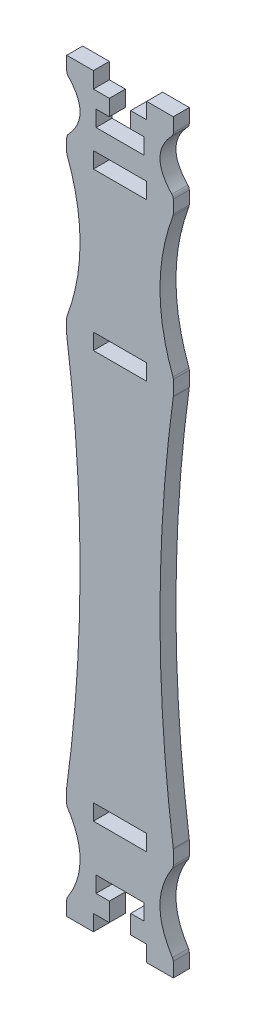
ISO-10303-21;
HEADER;
FILE_DESCRIPTION(('STEP AP214'),'2;1');
FILE_NAME('part.step','',(''),(''),'','','');
FILE_SCHEMA(('AUTOMOTIVE_DESIGN { 1 0 10303 214 1 1 1 1 }'));
ENDSEC;
DATA;
#1=APPLICATION_CONTEXT('core data for automotive mechanical design processes');
#2=APPLICATION_PROTOCOL_DEFINITION('international standard','automotive_design',2000,#1);
#3=PRODUCT_CONTEXT('',#1,'mechanical');
#4=PRODUCT('Part','Part','',(#3));
#5=PRODUCT_RELATED_PRODUCT_CATEGORY('part','',(#4));
#6=PRODUCT_DEFINITION_FORMATION('','',#4);
#7=PRODUCT_DEFINITION_CONTEXT('part definition',#1,'design');
#8=PRODUCT_DEFINITION('design','',#6,#7);
#9=PRODUCT_DEFINITION_SHAPE('','',#8);
#10=(LENGTH_UNIT() NAMED_UNIT(*) SI_UNIT(.MILLI.,.METRE.));
#11=(NAMED_UNIT(*) PLANE_ANGLE_UNIT() SI_UNIT($,.RADIAN.));
#12=(NAMED_UNIT(*) SI_UNIT($,.STERADIAN.) SOLID_ANGLE_UNIT());
#13=UNCERTAINTY_MEASURE_WITH_UNIT(LENGTH_MEASURE(1.E-05),#10,'distance_accuracy_value','');
#14=(GEOMETRIC_REPRESENTATION_CONTEXT(3) GLOBAL_UNCERTAINTY_ASSIGNED_CONTEXT((#13)) GLOBAL_UNIT_ASSIGNED_CONTEXT((#10,
#11,#12)) REPRESENTATION_CONTEXT('',''));
#15=CARTESIAN_POINT('',(0.,0.,0.));
#16=DIRECTION('',(0.,0.,1.));
#17=DIRECTION('',(1.,0.,0.));
#18=AXIS2_PLACEMENT_3D('',#15,#16,#17);
#19=CARTESIAN_POINT('',(3.99999999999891,-49.0676541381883,3.));
#20=DIRECTION('',(0.,0.,-1.));
#21=DIRECTION('',(-1.,0.,0.));
#22=AXIS2_PLACEMENT_3D('',#19,#20,#21);
#23=CYLINDRICAL_SURFACE('',#22,1.);
#24=CARTESIAN_POINT('',(3.99999999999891,-49.0676541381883,0.));
#25=DIRECTION('',(0.,0.,1.));
#26=DIRECTION('',(1.,0.,0.));
#27=AXIS2_PLACEMENT_3D('',#24,#25,#26);
#28=CIRCLE('',#27,1.);
#29=CARTESIAN_POINT('',(4.99999999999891,-49.0676541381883,0.));
#30=VERTEX_POINT('',#29);
#31=CARTESIAN_POINT('',(4.9909039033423,-48.9330827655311,0.));
#32=VERTEX_POINT('',#31);
#33=EDGE_CURVE('E559',#30,#32,#28,.T.);
#34=ORIENTED_EDGE('',*,*,#33,.T.);
#35=DIRECTION('',(0.,0.,-1.));
#36=VECTOR('',#35,1.);
#37=CARTESIAN_POINT('',(4.9909039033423,-48.9330827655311,3.));
#38=LINE('',#37,#36);
#39=CARTESIAN_POINT('',(4.9909039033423,-48.9330827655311,3.));
#40=VERTEX_POINT('',#39);
#41=EDGE_CURVE('E11',#40,#32,#38,.T.);
#42=ORIENTED_EDGE('',*,*,#41,.F.);
#43=CARTESIAN_POINT('',(3.99999999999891,-49.0676541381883,3.));
#44=DIRECTION('',(0.,0.,1.));
#45=DIRECTION('',(1.,0.,0.));
#46=AXIS2_PLACEMENT_3D('',#43,#44,#45);
#47=CIRCLE('',#46,1.);
#48=CARTESIAN_POINT('',(4.99999999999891,-49.0676541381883,3.));
#49=VERTEX_POINT('',#48);
#50=EDGE_CURVE('E957',#49,#40,#47,.T.);
#51=ORIENTED_EDGE('',*,*,#50,.F.);
#52=DIRECTION('',(0.,0.,-1.));
#53=VECTOR('',#52,1.);
#54=CARTESIAN_POINT('',(4.99999999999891,-49.0676541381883,3.));
#55=LINE('',#54,#53);
#56=EDGE_CURVE('E747',#49,#30,#55,.T.);
#57=ORIENTED_EDGE('',*,*,#56,.T.);
#58=EDGE_LOOP('',(#34,#42,#51,#57));
#59=FACE_BOUND('',#58,.T.);
#60=ADVANCED_FACE('F37',(#59),#23,.T.);
#61=CARTESIAN_POINT('',(4.9909039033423,-48.9330827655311,3.));
#62=CARTESIAN_POINT('',(3.33030130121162,-36.7053885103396,3.));
#63=CARTESIAN_POINT('',(1.66969869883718,-12.2500000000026,3.));
#64=CARTESIAN_POINT('',(3.33030130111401,12.2053885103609,3.));
#65=CARTESIAN_POINT('',(4.99090390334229,24.4330827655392,3.));
#66=B_SPLINE_CURVE_WITH_KNOTS('',3,(#61,#62,#63,#64,#65),.UNSPECIFIED.,.F.,.F.,(4,1,4),
(0.000910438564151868,0.5,0.999089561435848),.UNSPECIFIED.);
#67=DIRECTION('',(0.,0.,-1.));
#68=VECTOR('',#67,1.);
#69=SURFACE_OF_LINEAR_EXTRUSION('',#66,#68);
#70=CARTESIAN_POINT('',(4.9909039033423,-48.9330827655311,0.));
#71=CARTESIAN_POINT('',(3.33030130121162,-36.7053885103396,0.));
#72=CARTESIAN_POINT('',(1.66969869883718,-12.2500000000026,0.));
#73=CARTESIAN_POINT('',(3.33030130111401,12.2053885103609,0.));
#74=CARTESIAN_POINT('',(4.99090390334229,24.4330827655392,0.));
#75=B_SPLINE_CURVE_WITH_KNOTS('',3,(#70,#71,#72,#73,#74),.UNSPECIFIED.,.F.,.F.,(4,1,4),
(0.000910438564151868,0.5,0.999089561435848),.UNSPECIFIED.);
#76=CARTESIAN_POINT('',(4.9909039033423,24.4330827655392,0.));
#77=VERTEX_POINT('',#76);
#78=EDGE_CURVE('E562',#32,#77,#75,.T.);
#79=ORIENTED_EDGE('',*,*,#78,.T.);
#80=DIRECTION('',(0.,0.,-1.));
#81=VECTOR('',#80,1.);
#82=CARTESIAN_POINT('',(4.9909039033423,24.4330827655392,3.));
#83=LINE('',#82,#81);
#84=CARTESIAN_POINT('',(4.9909039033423,24.4330827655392,3.));
#85=VERTEX_POINT('',#84);
#86=EDGE_CURVE('E47',#85,#77,#83,.T.);
#87=ORIENTED_EDGE('',*,*,#86,.F.);
#88=EDGE_CURVE('E959',#40,#85,#66,.T.);
#89=ORIENTED_EDGE('',*,*,#88,.F.);
#90=ORIENTED_EDGE('',*,*,#41,.T.);
#91=EDGE_LOOP('',(#79,#87,#89,#90));
#92=FACE_BOUND('',#91,.T.);
#93=ADVANCED_FACE('F970',(#92),#69,.F.);
#94=CARTESIAN_POINT('',(3.99999999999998,24.5676541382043,3.));
#95=DIRECTION('',(0.,0.,-1.));
#96=DIRECTION('',(-1.,0.,0.));
#97=AXIS2_PLACEMENT_3D('',#94,#95,#96);
#98=CYLINDRICAL_SURFACE('',#97,1.);
#99=CARTESIAN_POINT('',(3.99999999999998,24.5676541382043,0.));
#100=DIRECTION('',(0.,0.,1.));
#101=DIRECTION('',(1.,0.,0.));
#102=AXIS2_PLACEMENT_3D('',#99,#100,#101);
#103=CIRCLE('',#102,1.);
#104=CARTESIAN_POINT('',(4.99999999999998,24.5676541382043,0.));
#105=VERTEX_POINT('',#104);
#106=EDGE_CURVE('E566',#77,#105,#103,.T.);
#107=ORIENTED_EDGE('',*,*,#106,.T.);
#108=DIRECTION('',(0.,0.,-1.));
#109=VECTOR('',#108,1.);
#110=CARTESIAN_POINT('',(4.99999999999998,24.5676541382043,3.));
#111=LINE('',#110,#109);
#112=CARTESIAN_POINT('',(4.99999999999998,24.5676541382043,3.));
#113=VERTEX_POINT('',#112);
#114=EDGE_CURVE('E882',#113,#105,#111,.T.);
#115=ORIENTED_EDGE('',*,*,#114,.F.);
#116=CARTESIAN_POINT('',(3.99999999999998,24.5676541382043,3.));
#117=DIRECTION('',(0.,0.,1.));
#118=DIRECTION('',(1.,0.,0.));
#119=AXIS2_PLACEMENT_3D('',#116,#117,#118);
#120=CIRCLE('',#119,1.);
#121=EDGE_CURVE('E964',#85,#113,#120,.T.);
#122=ORIENTED_EDGE('',*,*,#121,.F.);
#123=ORIENTED_EDGE('',*,*,#86,.T.);
#124=EDGE_LOOP('',(#107,#115,#122,#123));
#125=FACE_BOUND('',#124,.T.);
#126=ADVANCED_FACE('F974',(#125),#98,.T.);
#127=CARTESIAN_POINT('',(4.99999999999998,0.,3.));
#128=DIRECTION('',(-1.,0.,0.));
#129=DIRECTION('',(0.,0.,1.));
#130=AXIS2_PLACEMENT_3D('',#127,#128,#129);
#131=PLANE('',#130);
#132=DIRECTION('',(0.,1.,0.));
#133=VECTOR('',#132,1.);
#134=CARTESIAN_POINT('',(4.99999999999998,0.,0.));
#135=LINE('',#134,#133);
#136=CARTESIAN_POINT('',(4.99999999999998,27.318685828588,0.));
#137=VERTEX_POINT('',#136);
#138=EDGE_CURVE('E571',#105,#137,#135,.T.);
#139=ORIENTED_EDGE('',*,*,#138,.T.);
#140=DIRECTION('',(0.,0.,-1.));
#141=VECTOR('',#140,1.);
#142=CARTESIAN_POINT('',(4.99999999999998,27.318685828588,3.));
#143=LINE('',#142,#141);
#144=CARTESIAN_POINT('',(4.99999999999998,27.318685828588,3.));
#145=VERTEX_POINT('',#144);
#146=EDGE_CURVE('E879',#145,#137,#143,.T.);
#147=ORIENTED_EDGE('',*,*,#146,.F.);
#148=DIRECTION('',(0.,1.,0.));
#149=VECTOR('',#148,1.);
#150=CARTESIAN_POINT('',(4.99999999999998,0.,3.));
#151=LINE('',#150,#149);
#152=EDGE_CURVE('E1781',#113,#145,#151,.T.);
#153=ORIENTED_EDGE('',*,*,#152,.F.);
#154=ORIENTED_EDGE('',*,*,#114,.T.);
#155=EDGE_LOOP('',(#139,#147,#153,#154));
#156=FACE_BOUND('',#155,.T.);
#157=ADVANCED_FACE('F1481',(#156),#131,.F.);
#158=CARTESIAN_POINT('',(3.99999999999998,27.318685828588,3.));
#159=DIRECTION('',(0.,0.,-1.));
#160=DIRECTION('',(-1.,0.,0.));
#161=AXIS2_PLACEMENT_3D('',#158,#159,#160);
#162=CYLINDRICAL_SURFACE('',#161,1.);
#163=CARTESIAN_POINT('',(3.99999999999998,27.318685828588,0.));
#164=DIRECTION('',(0.,0.,1.));
#165=DIRECTION('',(1.,0.,0.));
#166=AXIS2_PLACEMENT_3D('',#163,#164,#165);
#167=CIRCLE('',#166,1.);
#168=CARTESIAN_POINT('',(4.93707292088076,27.6678195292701,0.));
#169=VERTEX_POINT('',#168);
#170=EDGE_CURVE('E573',#137,#169,#167,.T.);
#171=ORIENTED_EDGE('',*,*,#170,.T.);
#172=DIRECTION('',(0.,0.,-1.));
#173=VECTOR('',#172,1.);
#174=CARTESIAN_POINT('',(4.93707292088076,27.6678195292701,3.));
#175=LINE('',#174,#173);
#176=CARTESIAN_POINT('',(4.93707292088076,27.6678195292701,3.));
#177=VERTEX_POINT('',#176);
#178=EDGE_CURVE('E877',#177,#169,#175,.T.);
#179=ORIENTED_EDGE('',*,*,#178,.F.);
#180=CARTESIAN_POINT('',(3.99999999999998,27.318685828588,3.));
#181=DIRECTION('',(0.,0.,1.));
#182=DIRECTION('',(1.,0.,0.));
#183=AXIS2_PLACEMENT_3D('',#180,#181,#182);
#184=CIRCLE('',#183,1.);
#185=EDGE_CURVE('E1782',#145,#177,#184,.T.);
#186=ORIENTED_EDGE('',*,*,#185,.F.);
#187=ORIENTED_EDGE('',*,*,#146,.T.);
#188=EDGE_LOOP('',(#171,#179,#186,#187));
#189=FACE_BOUND('',#188,.T.);
#190=ADVANCED_FACE('F1473',(#189),#162,.T.);
#191=CARTESIAN_POINT('',(4.93707292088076,53.832180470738,3.));
#192=CARTESIAN_POINT('',(3.31235764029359,49.4714536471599,3.));
#193=CARTESIAN_POINT('',(1.68764235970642,40.750000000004,3.));
#194=CARTESIAN_POINT('',(3.31235764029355,32.0285463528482,3.));
#195=CARTESIAN_POINT('',(4.93707292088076,27.6678195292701,3.));
#196=B_SPLINE_CURVE_WITH_KNOTS('',3,(#191,#192,#193,#194,#195),.UNSPECIFIED.,.F.,.F.,(4,1,4),
(0.00633281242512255,0.5,0.993667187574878),.UNSPECIFIED.);
#197=DIRECTION('',(0.,0.,-1.));
#198=VECTOR('',#197,1.);
#199=SURFACE_OF_LINEAR_EXTRUSION('',#196,#198);
#200=CARTESIAN_POINT('',(4.93707292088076,53.832180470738,0.));
#201=CARTESIAN_POINT('',(3.31235764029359,49.4714536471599,0.));
#202=CARTESIAN_POINT('',(1.68764235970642,40.750000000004,0.));
#203=CARTESIAN_POINT('',(3.31235764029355,32.0285463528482,0.));
#204=CARTESIAN_POINT('',(4.93707292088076,27.6678195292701,0.));
#205=B_SPLINE_CURVE_WITH_KNOTS('',3,(#200,#201,#202,#203,#204),.UNSPECIFIED.,.F.,.F.,(4,1,4),
(0.00633281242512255,0.5,0.993667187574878),.UNSPECIFIED.);
#206=CARTESIAN_POINT('',(4.93707292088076,53.832180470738,0.));
#207=VERTEX_POINT('',#206);
#208=EDGE_CURVE('E576',#207,#169,#205,.T.);
#209=ORIENTED_EDGE('',*,*,#208,.F.);
#210=DIRECTION('',(0.,0.,-1.));
#211=VECTOR('',#210,1.);
#212=CARTESIAN_POINT('',(4.93707292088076,53.832180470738,3.));
#213=LINE('',#212,#211);
#214=CARTESIAN_POINT('',(4.93707292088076,53.832180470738,3.));
#215=VERTEX_POINT('',#214);
#216=EDGE_CURVE('E875',#215,#207,#213,.T.);
#217=ORIENTED_EDGE('',*,*,#216,.F.);
#218=EDGE_CURVE('E1784',#215,#177,#196,.T.);
#219=ORIENTED_EDGE('',*,*,#218,.T.);
#220=ORIENTED_EDGE('',*,*,#178,.T.);
#221=EDGE_LOOP('',(#209,#217,#219,#220));
#222=FACE_BOUND('',#221,.T.);
#223=ADVANCED_FACE('F1465',(#222),#199,.T.);
#224=CARTESIAN_POINT('',(3.99999999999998,54.1813141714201,3.));
#225=DIRECTION('',(0.,0.,-1.));
#226=DIRECTION('',(-1.,0.,0.));
#227=AXIS2_PLACEMENT_3D('',#224,#225,#226);
#228=CYLINDRICAL_SURFACE('',#227,0.999999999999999);
#229=CARTESIAN_POINT('',(3.99999999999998,54.1813141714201,0.));
#230=DIRECTION('',(0.,0.,1.));
#231=DIRECTION('',(1.,0.,0.));
#232=AXIS2_PLACEMENT_3D('',#229,#230,#231);
#233=CIRCLE('',#232,0.999999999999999);
#234=CARTESIAN_POINT('',(4.99999999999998,54.1813141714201,0.));
#235=VERTEX_POINT('',#234);
#236=EDGE_CURVE('E581',#207,#235,#233,.T.);
#237=ORIENTED_EDGE('',*,*,#236,.T.);
#238=DIRECTION('',(0.,0.,-1.));
#239=VECTOR('',#238,1.);
#240=CARTESIAN_POINT('',(4.99999999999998,54.1813141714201,3.));
#241=LINE('',#240,#239);
#242=CARTESIAN_POINT('',(4.99999999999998,54.1813141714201,3.));
#243=VERTEX_POINT('',#242);
#244=EDGE_CURVE('E872',#243,#235,#241,.T.);
#245=ORIENTED_EDGE('',*,*,#244,.F.);
#246=CARTESIAN_POINT('',(3.99999999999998,54.1813141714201,3.));
#247=DIRECTION('',(0.,0.,1.));
#248=DIRECTION('',(1.,0.,0.));
#249=AXIS2_PLACEMENT_3D('',#246,#247,#248);
#250=CIRCLE('',#249,0.999999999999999);
#251=EDGE_CURVE('E1792',#215,#243,#250,.T.);
#252=ORIENTED_EDGE('',*,*,#251,.F.);
#253=ORIENTED_EDGE('',*,*,#216,.T.);
#254=EDGE_LOOP('',(#237,#245,#252,#253));
#255=FACE_BOUND('',#254,.T.);
#256=ADVANCED_FACE('F1457',(#255),#228,.T.);
#257=CARTESIAN_POINT('',(4.99999999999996,0.,3.));
#258=DIRECTION('',(-1.,0.,0.));
#259=DIRECTION('',(0.,-1.,0.));
#260=AXIS2_PLACEMENT_3D('',#257,#258,#259);
#261=PLANE('',#260);
#262=DIRECTION('',(0.,1.,0.));
#263=VECTOR('',#262,1.);
#264=CARTESIAN_POINT('',(4.99999999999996,0.,0.));
#265=LINE('',#264,#263);
#266=CARTESIAN_POINT('',(4.99999999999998,56.594252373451,0.));
#267=VERTEX_POINT('',#266);
#268=EDGE_CURVE('E586',#235,#267,#265,.T.);
#269=ORIENTED_EDGE('',*,*,#268,.T.);
#270=DIRECTION('',(0.,0.,-1.));
#271=VECTOR('',#270,1.);
#272=CARTESIAN_POINT('',(4.99999999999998,56.594252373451,3.));
#273=LINE('',#272,#271);
#274=CARTESIAN_POINT('',(4.99999999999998,56.594252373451,3.));
#275=VERTEX_POINT('',#274);
#276=EDGE_CURVE('E869',#275,#267,#273,.T.);
#277=ORIENTED_EDGE('',*,*,#276,.F.);
#278=DIRECTION('',(0.,1.,0.));
#279=VECTOR('',#278,1.);
#280=CARTESIAN_POINT('',(4.99999999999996,0.,3.));
#281=LINE('',#280,#279);
#282=EDGE_CURVE('E2015',#243,#275,#281,.T.);
#283=ORIENTED_EDGE('',*,*,#282,.F.);
#284=ORIENTED_EDGE('',*,*,#244,.T.);
#285=EDGE_LOOP('',(#269,#277,#283,#284));
#286=FACE_BOUND('',#285,.T.);
#287=ADVANCED_FACE('F1449',(#286),#261,.F.);
#288=CARTESIAN_POINT('',(3.99999999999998,56.5942523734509,3.));
#289=DIRECTION('',(0.,0.,-1.));
#290=DIRECTION('',(-1.,0.,0.));
#291=AXIS2_PLACEMENT_3D('',#288,#289,#290);
#292=CYLINDRICAL_SURFACE('',#291,1.);
#293=CARTESIAN_POINT('',(3.99999999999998,56.5942523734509,0.));
#294=DIRECTION('',(0.,0.,1.));
#295=DIRECTION('',(1.,0.,0.));
#296=AXIS2_PLACEMENT_3D('',#293,#294,#295);
#297=CIRCLE('',#296,1.);
#298=CARTESIAN_POINT('',(4.72722199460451,57.2806547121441,0.));
#299=VERTEX_POINT('',#298);
#300=EDGE_CURVE('E588',#267,#299,#297,.T.);
#301=ORIENTED_EDGE('',*,*,#300,.T.);
#302=DIRECTION('',(0.,0.,-1.));
#303=VECTOR('',#302,1.);
#304=CARTESIAN_POINT('',(4.72722199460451,57.2806547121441,3.));
#305=LINE('',#304,#303);
#306=CARTESIAN_POINT('',(4.72722199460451,57.2806547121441,3.));
#307=VERTEX_POINT('',#306);
#308=EDGE_CURVE('E867',#307,#299,#305,.T.);
#309=ORIENTED_EDGE('',*,*,#308,.F.);
#310=CARTESIAN_POINT('',(3.99999999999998,56.5942523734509,3.));
#311=DIRECTION('',(0.,0.,1.));
#312=DIRECTION('',(1.,0.,0.));
#313=AXIS2_PLACEMENT_3D('',#310,#311,#312);
#314=CIRCLE('',#313,1.);
#315=EDGE_CURVE('E1806',#275,#307,#314,.T.);
#316=ORIENTED_EDGE('',*,*,#315,.F.);
#317=ORIENTED_EDGE('',*,*,#276,.T.);
#318=EDGE_LOOP('',(#301,#309,#316,#317));
#319=FACE_BOUND('',#318,.T.);
#320=ADVANCED_FACE('F1441',(#319),#292,.T.);
#321=CARTESIAN_POINT('',(4.72722199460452,66.7193452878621,3.));
#322=CARTESIAN_POINT('',(3.24240733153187,65.1462301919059,3.));
#323=CARTESIAN_POINT('',(1.757592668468,62.0000000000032,3.));
#324=CARTESIAN_POINT('',(3.24240733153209,58.8537698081,3.));
#325=CARTESIAN_POINT('',(4.72722199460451,57.2806547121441,3.));
#326=B_SPLINE_CURVE_WITH_KNOTS('',3,(#321,#322,#323,#324,#325),.UNSPECIFIED.,.F.,.F.,(4,1,4),
(0.0280654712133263,0.499999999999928,0.971934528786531),.UNSPECIFIED.);
#327=DIRECTION('',(0.,0.,-1.));
#328=VECTOR('',#327,1.);
#329=SURFACE_OF_LINEAR_EXTRUSION('',#326,#328);
#330=CARTESIAN_POINT('',(4.72722199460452,66.7193452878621,0.));
#331=CARTESIAN_POINT('',(3.24240733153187,65.1462301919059,0.));
#332=CARTESIAN_POINT('',(1.757592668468,62.0000000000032,0.));
#333=CARTESIAN_POINT('',(3.24240733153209,58.8537698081,0.));
#334=CARTESIAN_POINT('',(4.72722199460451,57.2806547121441,0.));
#335=B_SPLINE_CURVE_WITH_KNOTS('',3,(#330,#331,#332,#333,#334),.UNSPECIFIED.,.F.,.F.,(4,1,4),
(0.0280654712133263,0.499999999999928,0.971934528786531),.UNSPECIFIED.);
#336=CARTESIAN_POINT('',(4.72722199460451,66.7193452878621,0.));
#337=VERTEX_POINT('',#336);
#338=EDGE_CURVE('E591',#337,#299,#335,.T.);
#339=ORIENTED_EDGE('',*,*,#338,.F.);
#340=DIRECTION('',(0.,0.,-1.));
#341=VECTOR('',#340,1.);
#342=CARTESIAN_POINT('',(4.72722199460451,66.7193452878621,3.));
#343=LINE('',#342,#341);
#344=CARTESIAN_POINT('',(4.72722199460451,66.7193452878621,3.));
#345=VERTEX_POINT('',#344);
#346=EDGE_CURVE('E865',#345,#337,#343,.T.);
#347=ORIENTED_EDGE('',*,*,#346,.F.);
#348=EDGE_CURVE('E1798',#345,#307,#326,.T.);
#349=ORIENTED_EDGE('',*,*,#348,.T.);
#350=ORIENTED_EDGE('',*,*,#308,.T.);
#351=EDGE_LOOP('',(#339,#347,#349,#350));
#352=FACE_BOUND('',#351,.T.);
#353=ADVANCED_FACE('F1433',(#352),#329,.T.);
#354=CARTESIAN_POINT('',(3.99999999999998,67.4057476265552,3.));
#355=DIRECTION('',(0.,0.,-1.));
#356=DIRECTION('',(-1.,0.,0.));
#357=AXIS2_PLACEMENT_3D('',#354,#355,#356);
#358=CYLINDRICAL_SURFACE('',#357,1.00000000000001);
#359=CARTESIAN_POINT('',(3.99999999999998,67.4057476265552,0.));
#360=DIRECTION('',(0.,0.,1.));
#361=DIRECTION('',(1.,0.,0.));
#362=AXIS2_PLACEMENT_3D('',#359,#360,#361);
#363=CIRCLE('',#362,1.00000000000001);
#364=CARTESIAN_POINT('',(4.99999999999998,67.4057476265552,0.));
#365=VERTEX_POINT('',#364);
#366=EDGE_CURVE('E596',#337,#365,#363,.T.);
#367=ORIENTED_EDGE('',*,*,#366,.T.);
#368=DIRECTION('',(0.,0.,-1.));
#369=VECTOR('',#368,1.);
#370=CARTESIAN_POINT('',(4.99999999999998,67.4057476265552,3.));
#371=LINE('',#370,#369);
#372=CARTESIAN_POINT('',(4.99999999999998,67.4057476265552,3.));
#373=VERTEX_POINT('',#372);
#374=EDGE_CURVE('E862',#373,#365,#371,.T.);
#375=ORIENTED_EDGE('',*,*,#374,.F.);
#376=CARTESIAN_POINT('',(3.99999999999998,67.4057476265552,3.));
#377=DIRECTION('',(0.,0.,1.));
#378=DIRECTION('',(1.,0.,0.));
#379=AXIS2_PLACEMENT_3D('',#376,#377,#378);
#380=CIRCLE('',#379,1.00000000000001);
#381=EDGE_CURVE('E1805',#345,#373,#380,.T.);
#382=ORIENTED_EDGE('',*,*,#381,.F.);
#383=ORIENTED_EDGE('',*,*,#346,.T.);
#384=EDGE_LOOP('',(#367,#375,#382,#383));
#385=FACE_BOUND('',#384,.T.);
#386=ADVANCED_FACE('F1425',(#385),#358,.T.);
#387=CARTESIAN_POINT('',(4.99999999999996,0.,3.));
#388=DIRECTION('',(-1.,0.,0.));
#389=DIRECTION('',(0.,-1.,0.));
#390=AXIS2_PLACEMENT_3D('',#387,#388,#389);
#391=PLANE('',#390);
#392=DIRECTION('',(0.,1.,0.));
#393=VECTOR('',#392,1.);
#394=CARTESIAN_POINT('',(4.99999999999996,0.,0.));
#395=LINE('',#394,#393);
#396=CARTESIAN_POINT('',(4.99999999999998,70.0000000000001,0.));
#397=VERTEX_POINT('',#396);
#398=EDGE_CURVE('E601',#365,#397,#395,.T.);
#399=ORIENTED_EDGE('',*,*,#398,.T.);
#400=DIRECTION('',(0.,0.,-1.));
#401=VECTOR('',#400,1.);
#402=CARTESIAN_POINT('',(4.99999999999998,70.0000000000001,3.));
#403=LINE('',#402,#401);
#404=CARTESIAN_POINT('',(4.99999999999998,70.0000000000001,3.));
#405=VERTEX_POINT('',#404);
#406=EDGE_CURVE('E859',#405,#397,#403,.T.);
#407=ORIENTED_EDGE('',*,*,#406,.F.);
#408=DIRECTION('',(0.,1.,0.));
#409=VECTOR('',#408,1.);
#410=CARTESIAN_POINT('',(4.99999999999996,0.,3.));
#411=LINE('',#410,#409);
#412=EDGE_CURVE('E1811',#373,#405,#411,.T.);
#413=ORIENTED_EDGE('',*,*,#412,.F.);
#414=ORIENTED_EDGE('',*,*,#374,.T.);
#415=EDGE_LOOP('',(#399,#407,#413,#414));
#416=FACE_BOUND('',#415,.T.);
#417=ADVANCED_FACE('F1417',(#416),#391,.F.);
#418=CARTESIAN_POINT('',(0.,70.0000000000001,3.));
#419=DIRECTION('',(0.,-1.,0.));
#420=DIRECTION('',(0.,0.,-1.));
#421=AXIS2_PLACEMENT_3D('',#418,#419,#420);
#422=PLANE('',#421);
#423=DIRECTION('',(-1.,0.,0.));
#424=VECTOR('',#423,1.);
#425=CARTESIAN_POINT('',(0.,70.0000000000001,0.));
#426=LINE('',#425,#424);
#427=CARTESIAN_POINT('',(0.,70.0000000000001,0.));
#428=VERTEX_POINT('',#427);
#429=EDGE_CURVE('E603',#397,#428,#426,.T.);
#430=ORIENTED_EDGE('',*,*,#429,.T.);
#431=DIRECTION('',(0.,0.,-1.));
#432=VECTOR('',#431,1.);
#433=CARTESIAN_POINT('',(0.,70.0000000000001,3.));
#434=LINE('',#433,#432);
#435=CARTESIAN_POINT('',(0.,70.0000000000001,3.));
#436=VERTEX_POINT('',#435);
#437=EDGE_CURVE('E857',#436,#428,#434,.T.);
#438=ORIENTED_EDGE('',*,*,#437,.F.);
#439=DIRECTION('',(-1.,0.,0.));
#440=VECTOR('',#439,1.);
#441=CARTESIAN_POINT('',(0.,70.0000000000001,3.));
#442=LINE('',#441,#440);
#443=EDGE_CURVE('E1813',#405,#436,#442,.T.);
#444=ORIENTED_EDGE('',*,*,#443,.F.);
#445=ORIENTED_EDGE('',*,*,#406,.T.);
#446=EDGE_LOOP('',(#430,#438,#444,#445));
#447=FACE_BOUND('',#446,.T.);
#448=ADVANCED_FACE('F1409',(#447),#422,.F.);
#449=CARTESIAN_POINT('',(0.,0.,3.));
#450=DIRECTION('',(-1.,0.,0.));
#451=DIRECTION('',(0.,-1.,0.));
#452=AXIS2_PLACEMENT_3D('',#449,#450,#451);
#453=PLANE('',#452);
#454=DIRECTION('',(0.,1.,0.));
#455=VECTOR('',#454,1.);
#456=CARTESIAN_POINT('',(0.,0.,0.));
#457=LINE('',#456,#455);
#458=CARTESIAN_POINT('',(0.,67.0000000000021,0.));
#459=VERTEX_POINT('',#458);
#460=EDGE_CURVE('E606',#459,#428,#457,.T.);
#461=ORIENTED_EDGE('',*,*,#460,.F.);
#462=DIRECTION('',(0.,0.,-1.));
#463=VECTOR('',#462,1.);
#464=CARTESIAN_POINT('',(0.,67.0000000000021,3.));
#465=LINE('',#464,#463);
#466=CARTESIAN_POINT('',(0.,67.0000000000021,3.));
#467=VERTEX_POINT('',#466);
#468=EDGE_CURVE('E855',#467,#459,#465,.T.);
#469=ORIENTED_EDGE('',*,*,#468,.F.);
#470=DIRECTION('',(0.,1.,0.));
#471=VECTOR('',#470,1.);
#472=CARTESIAN_POINT('',(0.,0.,3.));
#473=LINE('',#472,#471);
#474=EDGE_CURVE('E1815',#467,#436,#473,.T.);
#475=ORIENTED_EDGE('',*,*,#474,.T.);
#476=ORIENTED_EDGE('',*,*,#437,.T.);
#477=EDGE_LOOP('',(#461,#469,#475,#476));
#478=FACE_BOUND('',#477,.T.);
#479=ADVANCED_FACE('F1401',(#478),#453,.T.);
#480=CARTESIAN_POINT('',(0.,67.0000000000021,3.));
#481=DIRECTION('',(0.,1.,0.));
#482=DIRECTION('',(0.,0.,1.));
#483=AXIS2_PLACEMENT_3D('',#480,#481,#482);
#484=PLANE('',#483);
#485=DIRECTION('',(1.,0.,0.));
#486=VECTOR('',#485,1.);
#487=CARTESIAN_POINT('',(0.,67.0000000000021,0.));
#488=LINE('',#487,#486);
#489=CARTESIAN_POINT('',(-2.99999999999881,67.0000000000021,0.));
#490=VERTEX_POINT('',#489);
#491=EDGE_CURVE('E609',#490,#459,#488,.T.);
#492=ORIENTED_EDGE('',*,*,#491,.F.);
#493=DIRECTION('',(0.,0.,-1.));
#494=VECTOR('',#493,1.);
#495=CARTESIAN_POINT('',(-2.99999999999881,67.0000000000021,3.));
#496=LINE('',#495,#494);
#497=CARTESIAN_POINT('',(-2.99999999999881,67.0000000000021,3.));
#498=VERTEX_POINT('',#497);
#499=EDGE_CURVE('E853',#498,#490,#496,.T.);
#500=ORIENTED_EDGE('',*,*,#499,.F.);
#501=DIRECTION('',(1.,0.,0.));
#502=VECTOR('',#501,1.);
#503=CARTESIAN_POINT('',(0.,67.0000000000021,3.));
#504=LINE('',#503,#502);
#505=EDGE_CURVE('E1818',#498,#467,#504,.T.);
#506=ORIENTED_EDGE('',*,*,#505,.T.);
#507=ORIENTED_EDGE('',*,*,#468,.T.);
#508=EDGE_LOOP('',(#492,#500,#506,#507));
#509=FACE_BOUND('',#508,.T.);
#510=ADVANCED_FACE('F1393',(#509),#484,.T.);
#511=CARTESIAN_POINT('',(-2.99999999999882,0.,3.));
#512=DIRECTION('',(-1.,0.,0.));
#513=DIRECTION('',(0.,-1.,0.));
#514=AXIS2_PLACEMENT_3D('',#511,#512,#513);
#515=PLANE('',#514);
#516=DIRECTION('',(0.,1.,0.));
#517=VECTOR('',#516,1.);
#518=CARTESIAN_POINT('',(-2.99999999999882,0.,0.));
#519=LINE('',#518,#517);
#520=CARTESIAN_POINT('',(-2.99999999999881,64.0000000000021,0.));
#521=VERTEX_POINT('',#520);
#522=EDGE_CURVE('E612',#521,#490,#519,.T.);
#523=ORIENTED_EDGE('',*,*,#522,.F.);
#524=DIRECTION('',(0.,0.,-1.));
#525=VECTOR('',#524,1.);
#526=CARTESIAN_POINT('',(-2.99999999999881,64.0000000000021,3.));
#527=LINE('',#526,#525);
#528=CARTESIAN_POINT('',(-2.99999999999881,64.0000000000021,3.));
#529=VERTEX_POINT('',#528);
#530=EDGE_CURVE('E851',#529,#521,#527,.T.);
#531=ORIENTED_EDGE('',*,*,#530,.F.);
#532=DIRECTION('',(0.,1.,0.));
#533=VECTOR('',#532,1.);
#534=CARTESIAN_POINT('',(-2.99999999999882,0.,3.));
#535=LINE('',#534,#533);
#536=EDGE_CURVE('E1821',#529,#498,#535,.T.);
#537=ORIENTED_EDGE('',*,*,#536,.T.);
#538=ORIENTED_EDGE('',*,*,#499,.T.);
#539=EDGE_LOOP('',(#523,#531,#537,#538));
#540=FACE_BOUND('',#539,.T.);
#541=ADVANCED_FACE('F1385',(#540),#515,.T.);
#542=CARTESIAN_POINT('',(0.,64.0000000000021,3.));
#543=DIRECTION('',(0.,-1.,0.));
#544=DIRECTION('',(0.,0.,-1.));
#545=AXIS2_PLACEMENT_3D('',#542,#543,#544);
#546=PLANE('',#545);
#547=DIRECTION('',(-1.,0.,0.));
#548=VECTOR('',#547,1.);
#549=CARTESIAN_POINT('',(0.,64.0000000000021,0.));
#550=LINE('',#549,#548);
#551=CARTESIAN_POINT('',(-0.499999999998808,64.0000000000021,0.));
#552=VERTEX_POINT('',#551);
#553=EDGE_CURVE('E615',#552,#521,#550,.T.);
#554=ORIENTED_EDGE('',*,*,#553,.F.);
#555=DIRECTION('',(0.,0.,-1.));
#556=VECTOR('',#555,1.);
#557=CARTESIAN_POINT('',(-0.499999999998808,64.0000000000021,3.));
#558=LINE('',#557,#556);
#559=CARTESIAN_POINT('',(-0.499999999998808,64.0000000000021,3.));
#560=VERTEX_POINT('',#559);
#561=EDGE_CURVE('E849',#560,#552,#558,.T.);
#562=ORIENTED_EDGE('',*,*,#561,.F.);
#563=DIRECTION('',(-1.,0.,0.));
#564=VECTOR('',#563,1.);
#565=CARTESIAN_POINT('',(0.,64.0000000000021,3.));
#566=LINE('',#565,#564);
#567=EDGE_CURVE('E1824',#560,#529,#566,.T.);
#568=ORIENTED_EDGE('',*,*,#567,.T.);
#569=ORIENTED_EDGE('',*,*,#530,.T.);
#570=EDGE_LOOP('',(#554,#562,#568,#569));
#571=FACE_BOUND('',#570,.T.);
#572=ADVANCED_FACE('F1377',(#571),#546,.T.);
#573=CARTESIAN_POINT('',(-0.499999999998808,0.,3.));
#574=DIRECTION('',(-1.,0.,0.));
#575=DIRECTION('',(0.,0.,1.));
#576=AXIS2_PLACEMENT_3D('',#573,#574,#575);
#577=PLANE('',#576);
#578=DIRECTION('',(0.,1.,0.));
#579=VECTOR('',#578,1.);
#580=CARTESIAN_POINT('',(-0.499999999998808,0.,0.));
#581=LINE('',#580,#579);
#582=CARTESIAN_POINT('',(-0.499999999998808,61.0000000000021,0.));
#583=VERTEX_POINT('',#582);
#584=EDGE_CURVE('E618',#583,#552,#581,.T.);
#585=ORIENTED_EDGE('',*,*,#584,.F.);
#586=DIRECTION('',(0.,0.,-1.));
#587=VECTOR('',#586,1.);
#588=CARTESIAN_POINT('',(-0.499999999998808,61.0000000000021,3.));
#589=LINE('',#588,#587);
#590=CARTESIAN_POINT('',(-0.499999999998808,61.0000000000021,3.));
#591=VERTEX_POINT('',#590);
#592=EDGE_CURVE('E847',#591,#583,#589,.T.);
#593=ORIENTED_EDGE('',*,*,#592,.F.);
#594=DIRECTION('',(0.,1.,0.));
#595=VECTOR('',#594,1.);
#596=CARTESIAN_POINT('',(-0.499999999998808,0.,3.));
#597=LINE('',#596,#595);
#598=EDGE_CURVE('E1827',#591,#560,#597,.T.);
#599=ORIENTED_EDGE('',*,*,#598,.T.);
#600=ORIENTED_EDGE('',*,*,#561,.T.);
#601=EDGE_LOOP('',(#585,#593,#599,#600));
#602=FACE_BOUND('',#601,.T.);
#603=ADVANCED_FACE('F1369',(#602),#577,.T.);
#604=CARTESIAN_POINT('',(0.,61.0000000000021,3.));
#605=DIRECTION('',(0.,1.,0.));
#606=DIRECTION('',(0.,0.,1.));
#607=AXIS2_PLACEMENT_3D('',#604,#605,#606);
#608=PLANE('',#607);
#609=DIRECTION('',(1.,0.,0.));
#610=VECTOR('',#609,1.);
#611=CARTESIAN_POINT('',(0.,61.0000000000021,0.));
#612=LINE('',#611,#610);
#613=CARTESIAN_POINT('',(-9.49999999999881,61.0000000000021,0.));
#614=VERTEX_POINT('',#613);
#615=EDGE_CURVE('E621',#614,#583,#612,.T.);
#616=ORIENTED_EDGE('',*,*,#615,.F.);
#617=DIRECTION('',(0.,0.,-1.));
#618=VECTOR('',#617,1.);
#619=CARTESIAN_POINT('',(-9.49999999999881,61.0000000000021,3.));
#620=LINE('',#619,#618);
#621=CARTESIAN_POINT('',(-9.49999999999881,61.0000000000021,3.));
#622=VERTEX_POINT('',#621);
#623=EDGE_CURVE('E845',#622,#614,#620,.T.);
#624=ORIENTED_EDGE('',*,*,#623,.F.);
#625=DIRECTION('',(1.,0.,0.));
#626=VECTOR('',#625,1.);
#627=CARTESIAN_POINT('',(0.,61.0000000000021,3.));
#628=LINE('',#627,#626);
#629=EDGE_CURVE('E1830',#622,#591,#628,.T.);
#630=ORIENTED_EDGE('',*,*,#629,.T.);
#631=ORIENTED_EDGE('',*,*,#592,.T.);
#632=EDGE_LOOP('',(#616,#624,#630,#631));
#633=FACE_BOUND('',#632,.T.);
#634=ADVANCED_FACE('F1361',(#633),#608,.T.);
#635=CARTESIAN_POINT('',(-9.49999999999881,0.,3.));
#636=DIRECTION('',(-1.,0.,0.));
#637=DIRECTION('',(0.,0.,1.));
#638=AXIS2_PLACEMENT_3D('',#635,#636,#637);
#639=PLANE('',#638);
#640=DIRECTION('',(0.,1.,0.));
#641=VECTOR('',#640,1.);
#642=CARTESIAN_POINT('',(-9.49999999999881,0.,0.));
#643=LINE('',#642,#641);
#644=CARTESIAN_POINT('',(-9.49999999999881,64.0000000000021,0.));
#645=VERTEX_POINT('',#644);
#646=EDGE_CURVE('E624',#614,#645,#643,.T.);
#647=ORIENTED_EDGE('',*,*,#646,.T.);
#648=DIRECTION('',(0.,0.,-1.));
#649=VECTOR('',#648,1.);
#650=CARTESIAN_POINT('',(-9.49999999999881,64.0000000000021,3.));
#651=LINE('',#650,#649);
#652=CARTESIAN_POINT('',(-9.49999999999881,64.0000000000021,3.));
#653=VERTEX_POINT('',#652);
#654=EDGE_CURVE('E842',#653,#645,#651,.T.);
#655=ORIENTED_EDGE('',*,*,#654,.F.);
#656=DIRECTION('',(0.,1.,0.));
#657=VECTOR('',#656,1.);
#658=CARTESIAN_POINT('',(-9.49999999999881,0.,3.));
#659=LINE('',#658,#657);
#660=EDGE_CURVE('E1833',#622,#653,#659,.T.);
#661=ORIENTED_EDGE('',*,*,#660,.F.);
#662=ORIENTED_EDGE('',*,*,#623,.T.);
#663=EDGE_LOOP('',(#647,#655,#661,#662));
#664=FACE_BOUND('',#663,.T.);
#665=ADVANCED_FACE('F1353',(#664),#639,.F.);
#666=CARTESIAN_POINT('',(0.,64.0000000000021,3.));
#667=DIRECTION('',(0.,1.,0.));
#668=DIRECTION('',(0.,0.,1.));
#669=AXIS2_PLACEMENT_3D('',#666,#667,#668);
#670=PLANE('',#669);
#671=DIRECTION('',(1.,0.,0.));
#672=VECTOR('',#671,1.);
#673=CARTESIAN_POINT('',(0.,64.0000000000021,0.));
#674=LINE('',#673,#672);
#675=CARTESIAN_POINT('',(-6.99999999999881,64.0000000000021,0.));
#676=VERTEX_POINT('',#675);
#677=EDGE_CURVE('E626',#645,#676,#674,.T.);
#678=ORIENTED_EDGE('',*,*,#677,.T.);
#679=DIRECTION('',(0.,0.,-1.));
#680=VECTOR('',#679,1.);
#681=CARTESIAN_POINT('',(-6.99999999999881,64.0000000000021,3.));
#682=LINE('',#681,#680);
#683=CARTESIAN_POINT('',(-6.99999999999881,64.0000000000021,3.));
#684=VERTEX_POINT('',#683);
#685=EDGE_CURVE('E839',#684,#676,#682,.T.);
#686=ORIENTED_EDGE('',*,*,#685,.F.);
#687=DIRECTION('',(1.,0.,0.));
#688=VECTOR('',#687,1.);
#689=CARTESIAN_POINT('',(0.,64.0000000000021,3.));
#690=LINE('',#689,#688);
#691=EDGE_CURVE('E1835',#653,#684,#690,.T.);
#692=ORIENTED_EDGE('',*,*,#691,.F.);
#693=ORIENTED_EDGE('',*,*,#654,.T.);
#694=EDGE_LOOP('',(#678,#686,#692,#693));
#695=FACE_BOUND('',#694,.T.);
#696=ADVANCED_FACE('F1345',(#695),#670,.F.);
#697=CARTESIAN_POINT('',(-6.99999999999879,0.,3.));
#698=DIRECTION('',(-1.,0.,0.));
#699=DIRECTION('',(0.,-1.,0.));
#700=AXIS2_PLACEMENT_3D('',#697,#698,#699);
#701=PLANE('',#700);
#702=DIRECTION('',(0.,1.,0.));
#703=VECTOR('',#702,1.);
#704=CARTESIAN_POINT('',(-6.99999999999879,0.,0.));
#705=LINE('',#704,#703);
#706=CARTESIAN_POINT('',(-6.99999999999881,67.0000000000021,0.));
#707=VERTEX_POINT('',#706);
#708=EDGE_CURVE('E628',#676,#707,#705,.T.);
#709=ORIENTED_EDGE('',*,*,#708,.T.);
#710=DIRECTION('',(0.,0.,-1.));
#711=VECTOR('',#710,1.);
#712=CARTESIAN_POINT('',(-6.99999999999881,67.0000000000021,3.));
#713=LINE('',#712,#711);
#714=CARTESIAN_POINT('',(-6.99999999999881,67.0000000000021,3.));
#715=VERTEX_POINT('',#714);
#716=EDGE_CURVE('E836',#715,#707,#713,.T.);
#717=ORIENTED_EDGE('',*,*,#716,.F.);
#718=DIRECTION('',(0.,1.,0.));
#719=VECTOR('',#718,1.);
#720=CARTESIAN_POINT('',(-6.99999999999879,0.,3.));
#721=LINE('',#720,#719);
#722=EDGE_CURVE('E1837',#684,#715,#721,.T.);
#723=ORIENTED_EDGE('',*,*,#722,.F.);
#724=ORIENTED_EDGE('',*,*,#685,.T.);
#725=EDGE_LOOP('',(#709,#717,#723,#724));
#726=FACE_BOUND('',#725,.T.);
#727=ADVANCED_FACE('F1337',(#726),#701,.F.);
#728=CARTESIAN_POINT('',(0.,67.0000000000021,3.));
#729=DIRECTION('',(0.,-1.,0.));
#730=DIRECTION('',(0.,0.,-1.));
#731=AXIS2_PLACEMENT_3D('',#728,#729,#730);
#732=PLANE('',#731);
#733=DIRECTION('',(-1.,0.,0.));
#734=VECTOR('',#733,1.);
#735=CARTESIAN_POINT('',(0.,67.0000000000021,0.));
#736=LINE('',#735,#734);
#737=CARTESIAN_POINT('',(-9.99999999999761,67.0000000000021,0.));
#738=VERTEX_POINT('',#737);
#739=EDGE_CURVE('E630',#707,#738,#736,.T.);
#740=ORIENTED_EDGE('',*,*,#739,.T.);
#741=DIRECTION('',(0.,0.,-1.));
#742=VECTOR('',#741,1.);
#743=CARTESIAN_POINT('',(-9.99999999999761,67.0000000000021,3.));
#744=LINE('',#743,#742);
#745=CARTESIAN_POINT('',(-9.99999999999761,67.0000000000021,3.));
#746=VERTEX_POINT('',#745);
#747=EDGE_CURVE('E834',#746,#738,#744,.T.);
#748=ORIENTED_EDGE('',*,*,#747,.F.);
#749=DIRECTION('',(-1.,0.,0.));
#750=VECTOR('',#749,1.);
#751=CARTESIAN_POINT('',(0.,67.0000000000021,3.));
#752=LINE('',#751,#750);
#753=EDGE_CURVE('E1839',#715,#746,#752,.T.);
#754=ORIENTED_EDGE('',*,*,#753,.F.);
#755=ORIENTED_EDGE('',*,*,#716,.T.);
#756=EDGE_LOOP('',(#740,#748,#754,#755));
#757=FACE_BOUND('',#756,.T.);
#758=ADVANCED_FACE('F1329',(#757),#732,.F.);
#759=CARTESIAN_POINT('',(-9.99999999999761,0.,3.));
#760=DIRECTION('',(1.,0.,0.));
#761=DIRECTION('',(0.,0.,-1.));
#762=AXIS2_PLACEMENT_3D('',#759,#760,#761);
#763=PLANE('',#762);
#764=DIRECTION('',(0.,-1.,0.));
#765=VECTOR('',#764,1.);
#766=CARTESIAN_POINT('',(-9.99999999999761,0.,0.));
#767=LINE('',#766,#765);
#768=CARTESIAN_POINT('',(-9.99999999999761,70.0000000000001,0.));
#769=VERTEX_POINT('',#768);
#770=EDGE_CURVE('E633',#769,#738,#767,.T.);
#771=ORIENTED_EDGE('',*,*,#770,.F.);
#772=DIRECTION('',(0.,0.,-1.));
#773=VECTOR('',#772,1.);
#774=CARTESIAN_POINT('',(-9.99999999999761,70.0000000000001,3.));
#775=LINE('',#774,#773);
#776=CARTESIAN_POINT('',(-9.99999999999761,70.0000000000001,3.));
#777=VERTEX_POINT('',#776);
#778=EDGE_CURVE('E832',#777,#769,#775,.T.);
#779=ORIENTED_EDGE('',*,*,#778,.F.);
#780=DIRECTION('',(0.,-1.,0.));
#781=VECTOR('',#780,1.);
#782=CARTESIAN_POINT('',(-9.99999999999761,0.,3.));
#783=LINE('',#782,#781);
#784=EDGE_CURVE('E1841',#777,#746,#783,.T.);
#785=ORIENTED_EDGE('',*,*,#784,.T.);
#786=ORIENTED_EDGE('',*,*,#747,.T.);
#787=EDGE_LOOP('',(#771,#779,#785,#786));
#788=FACE_BOUND('',#787,.T.);
#789=ADVANCED_FACE('F1321',(#788),#763,.T.);
#790=CARTESIAN_POINT('',(0.,70.0000000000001,3.));
#791=DIRECTION('',(0.,-1.,0.));
#792=DIRECTION('',(0.,0.,-1.));
#793=AXIS2_PLACEMENT_3D('',#790,#791,#792);
#794=PLANE('',#793);
#795=DIRECTION('',(-1.,0.,0.));
#796=VECTOR('',#795,1.);
#797=CARTESIAN_POINT('',(0.,70.0000000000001,0.));
#798=LINE('',#797,#796);
#799=CARTESIAN_POINT('',(-15.000000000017,70.0000000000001,0.));
#800=VERTEX_POINT('',#799);
#801=EDGE_CURVE('E636',#769,#800,#798,.T.);
#802=ORIENTED_EDGE('',*,*,#801,.T.);
#803=DIRECTION('',(0.,0.,-1.));
#804=VECTOR('',#803,1.);
#805=CARTESIAN_POINT('',(-15.000000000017,70.0000000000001,3.));
#806=LINE('',#805,#804);
#807=CARTESIAN_POINT('',(-15.000000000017,70.0000000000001,3.));
#808=VERTEX_POINT('',#807);
#809=EDGE_CURVE('E829',#808,#800,#806,.T.);
#810=ORIENTED_EDGE('',*,*,#809,.F.);
#811=DIRECTION('',(-1.,0.,0.));
#812=VECTOR('',#811,1.);
#813=CARTESIAN_POINT('',(0.,70.0000000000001,3.));
#814=LINE('',#813,#812);
#815=EDGE_CURVE('E1844',#777,#808,#814,.T.);
#816=ORIENTED_EDGE('',*,*,#815,.F.);
#817=ORIENTED_EDGE('',*,*,#778,.T.);
#818=EDGE_LOOP('',(#802,#810,#816,#817));
#819=FACE_BOUND('',#818,.T.);
#820=ADVANCED_FACE('F1313',(#819),#794,.F.);
#821=CARTESIAN_POINT('',(-15.000000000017,0.,3.));
#822=DIRECTION('',(1.,0.,0.));
#823=DIRECTION('',(0.,0.,-1.));
#824=AXIS2_PLACEMENT_3D('',#821,#822,#823);
#825=PLANE('',#824);
#826=DIRECTION('',(0.,-1.,0.));
#827=VECTOR('',#826,1.);
#828=CARTESIAN_POINT('',(-15.000000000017,0.,0.));
#829=LINE('',#828,#827);
#830=CARTESIAN_POINT('',(-15.000000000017,67.4057476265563,0.));
#831=VERTEX_POINT('',#830);
#832=EDGE_CURVE('E638',#800,#831,#829,.T.);
#833=ORIENTED_EDGE('',*,*,#832,.T.);
#834=DIRECTION('',(0.,0.,-1.));
#835=VECTOR('',#834,1.);
#836=CARTESIAN_POINT('',(-15.000000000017,67.4057476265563,3.));
#837=LINE('',#836,#835);
#838=CARTESIAN_POINT('',(-15.000000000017,67.4057476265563,3.));
#839=VERTEX_POINT('',#838);
#840=EDGE_CURVE('E826',#839,#831,#837,.T.);
#841=ORIENTED_EDGE('',*,*,#840,.F.);
#842=DIRECTION('',(0.,-1.,0.));
#843=VECTOR('',#842,1.);
#844=CARTESIAN_POINT('',(-15.000000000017,0.,3.));
#845=LINE('',#844,#843);
#846=EDGE_CURVE('E1846',#808,#839,#845,.T.);
#847=ORIENTED_EDGE('',*,*,#846,.F.);
#848=ORIENTED_EDGE('',*,*,#809,.T.);
#849=EDGE_LOOP('',(#833,#841,#847,#848));
#850=FACE_BOUND('',#849,.T.);
#851=ADVANCED_FACE('F1305',(#850),#825,.F.);
#852=CARTESIAN_POINT('',(-14.000000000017,67.4057476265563,3.));
#853=DIRECTION('',(0.,0.,-1.));
#854=DIRECTION('',(-1.,0.,0.));
#855=AXIS2_PLACEMENT_3D('',#852,#853,#854);
#856=CYLINDRICAL_SURFACE('',#855,1.);
#857=CARTESIAN_POINT('',(-14.000000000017,67.4057476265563,0.));
#858=DIRECTION('',(0.,0.,1.));
#859=DIRECTION('',(1.,0.,0.));
#860=AXIS2_PLACEMENT_3D('',#857,#858,#859);
#861=CIRCLE('',#860,1.);
#862=CARTESIAN_POINT('',(-14.7272219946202,66.7193452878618,0.));
#863=VERTEX_POINT('',#862);
#864=EDGE_CURVE('E640',#831,#863,#861,.T.);
#865=ORIENTED_EDGE('',*,*,#864,.T.);
#866=DIRECTION('',(0.,0.,-1.));
#867=VECTOR('',#866,1.);
#868=CARTESIAN_POINT('',(-14.7272219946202,66.7193452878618,3.));
#869=LINE('',#868,#867);
#870=CARTESIAN_POINT('',(-14.7272219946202,66.7193452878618,3.));
#871=VERTEX_POINT('',#870);
#872=EDGE_CURVE('E824',#871,#863,#869,.T.);
#873=ORIENTED_EDGE('',*,*,#872,.F.);
#874=CARTESIAN_POINT('',(-14.000000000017,67.4057476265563,3.));
#875=DIRECTION('',(0.,0.,1.));
#876=DIRECTION('',(1.,0.,0.));
#877=AXIS2_PLACEMENT_3D('',#874,#875,#876);
#878=CIRCLE('',#877,1.);
#879=EDGE_CURVE('E1848',#839,#871,#878,.T.);
#880=ORIENTED_EDGE('',*,*,#879,.F.);
#881=ORIENTED_EDGE('',*,*,#840,.T.);
#882=EDGE_LOOP('',(#865,#873,#880,#881));
#883=FACE_BOUND('',#882,.T.);
#884=ADVANCED_FACE('F1297',(#883),#856,.T.);
#885=CARTESIAN_POINT('',(-14.7272219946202,57.2806547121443,3.));
#886=CARTESIAN_POINT('',(-13.242407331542,58.8537698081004,3.));
#887=CARTESIAN_POINT('',(-11.7575926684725,62.000000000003,3.));
#888=CARTESIAN_POINT('',(-13.2424073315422,65.146230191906,3.));
#889=CARTESIAN_POINT('',(-14.7272219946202,66.7193452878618,3.));
#890=B_SPLINE_CURVE_WITH_KNOTS('',3,(#885,#886,#887,#888,#889),.UNSPECIFIED.,.F.,.F.,(4,1,4),
(0.0280654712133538,0.49999999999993,0.971934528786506),.UNSPECIFIED.);
#891=DIRECTION('',(0.,0.,-1.));
#892=VECTOR('',#891,1.);
#893=SURFACE_OF_LINEAR_EXTRUSION('',#890,#892);
#894=CARTESIAN_POINT('',(-14.7272219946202,57.2806547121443,0.));
#895=CARTESIAN_POINT('',(-13.242407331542,58.8537698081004,0.));
#896=CARTESIAN_POINT('',(-11.7575926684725,62.000000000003,0.));
#897=CARTESIAN_POINT('',(-13.2424073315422,65.146230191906,0.));
#898=CARTESIAN_POINT('',(-14.7272219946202,66.7193452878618,0.));
#899=B_SPLINE_CURVE_WITH_KNOTS('',3,(#894,#895,#896,#897,#898),.UNSPECIFIED.,.F.,.F.,(4,1,4),
(0.0280654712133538,0.49999999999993,0.971934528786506),.UNSPECIFIED.);
#900=CARTESIAN_POINT('',(-14.7272219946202,57.2806547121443,0.));
#901=VERTEX_POINT('',#900);
#902=EDGE_CURVE('E643',#901,#863,#899,.T.);
#903=ORIENTED_EDGE('',*,*,#902,.F.);
#904=DIRECTION('',(0.,0.,-1.));
#905=VECTOR('',#904,1.);
#906=CARTESIAN_POINT('',(-14.7272219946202,57.2806547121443,3.));
#907=LINE('',#906,#905);
#908=CARTESIAN_POINT('',(-14.7272219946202,57.2806547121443,3.));
#909=VERTEX_POINT('',#908);
#910=EDGE_CURVE('E822',#909,#901,#907,.T.);
#911=ORIENTED_EDGE('',*,*,#910,.F.);
#912=EDGE_CURVE('E1850',#909,#871,#890,.T.);
#913=ORIENTED_EDGE('',*,*,#912,.T.);
#914=ORIENTED_EDGE('',*,*,#872,.T.);
#915=EDGE_LOOP('',(#903,#911,#913,#914));
#916=FACE_BOUND('',#915,.T.);
#917=ADVANCED_FACE('F1289',(#916),#893,.T.);
#918=CARTESIAN_POINT('',(-14.000000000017,56.5942523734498,3.));
#919=DIRECTION('',(0.,0.,-1.));
#920=DIRECTION('',(-1.,0.,0.));
#921=AXIS2_PLACEMENT_3D('',#918,#919,#920);
#922=CYLINDRICAL_SURFACE('',#921,0.999999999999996);
#923=CARTESIAN_POINT('',(-14.000000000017,56.5942523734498,0.));
#924=DIRECTION('',(0.,0.,1.));
#925=DIRECTION('',(1.,0.,0.));
#926=AXIS2_PLACEMENT_3D('',#923,#924,#925);
#927=CIRCLE('',#926,0.999999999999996);
#928=CARTESIAN_POINT('',(-15.000000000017,56.5942523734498,0.));
#929=VERTEX_POINT('',#928);
#930=EDGE_CURVE('E648',#901,#929,#927,.T.);
#931=ORIENTED_EDGE('',*,*,#930,.T.);
#932=DIRECTION('',(0.,0.,-1.));
#933=VECTOR('',#932,1.);
#934=CARTESIAN_POINT('',(-15.000000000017,56.5942523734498,3.));
#935=LINE('',#934,#933);
#936=CARTESIAN_POINT('',(-15.000000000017,56.5942523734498,3.));
#937=VERTEX_POINT('',#936);
#938=EDGE_CURVE('E819',#937,#929,#935,.T.);
#939=ORIENTED_EDGE('',*,*,#938,.F.);
#940=CARTESIAN_POINT('',(-14.000000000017,56.5942523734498,3.));
#941=DIRECTION('',(0.,0.,1.));
#942=DIRECTION('',(1.,0.,0.));
#943=AXIS2_PLACEMENT_3D('',#940,#941,#942);
#944=CIRCLE('',#943,0.999999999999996);
#945=EDGE_CURVE('E1856',#909,#937,#944,.T.);
#946=ORIENTED_EDGE('',*,*,#945,.F.);
#947=ORIENTED_EDGE('',*,*,#910,.T.);
#948=EDGE_LOOP('',(#931,#939,#946,#947));
#949=FACE_BOUND('',#948,.T.);
#950=ADVANCED_FACE('F1281',(#949),#922,.T.);
#951=CARTESIAN_POINT('',(-15.000000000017,0.,3.));
#952=DIRECTION('',(1.,0.,0.));
#953=DIRECTION('',(0.,0.,-1.));
#954=AXIS2_PLACEMENT_3D('',#951,#952,#953);
#955=PLANE('',#954);
#956=DIRECTION('',(0.,-1.,0.));
#957=VECTOR('',#956,1.);
#958=CARTESIAN_POINT('',(-15.000000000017,0.,0.));
#959=LINE('',#958,#957);
#960=CARTESIAN_POINT('',(-15.000000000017,54.1813141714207,0.));
#961=VERTEX_POINT('',#960);
#962=EDGE_CURVE('E653',#929,#961,#959,.T.);
#963=ORIENTED_EDGE('',*,*,#962,.T.);
#964=DIRECTION('',(0.,0.,-1.));
#965=VECTOR('',#964,1.);
#966=CARTESIAN_POINT('',(-15.000000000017,54.1813141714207,3.));
#967=LINE('',#966,#965);
#968=CARTESIAN_POINT('',(-15.000000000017,54.1813141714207,3.));
#969=VERTEX_POINT('',#968);
#970=EDGE_CURVE('E816',#969,#961,#967,.T.);
#971=ORIENTED_EDGE('',*,*,#970,.F.);
#972=DIRECTION('',(0.,-1.,0.));
#973=VECTOR('',#972,1.);
#974=CARTESIAN_POINT('',(-15.000000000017,0.,3.));
#975=LINE('',#974,#973);
#976=EDGE_CURVE('E1954',#937,#969,#975,.T.);
#977=ORIENTED_EDGE('',*,*,#976,.F.);
#978=ORIENTED_EDGE('',*,*,#938,.T.);
#979=EDGE_LOOP('',(#963,#971,#977,#978));
#980=FACE_BOUND('',#979,.T.);
#981=ADVANCED_FACE('F1273',(#980),#955,.F.);
#982=CARTESIAN_POINT('',(-14.000000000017,54.1813141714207,3.));
#983=DIRECTION('',(0.,0.,-1.));
#984=DIRECTION('',(-1.,0.,0.));
#985=AXIS2_PLACEMENT_3D('',#982,#983,#984);
#986=CYLINDRICAL_SURFACE('',#985,1.);
#987=CARTESIAN_POINT('',(-14.000000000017,54.1813141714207,0.));
#988=DIRECTION('',(0.,0.,1.));
#989=DIRECTION('',(1.,0.,0.));
#990=AXIS2_PLACEMENT_3D('',#987,#988,#989);
#991=CIRCLE('',#990,1.);
#992=CARTESIAN_POINT('',(-14.9370729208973,53.8321804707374,0.));
#993=VERTEX_POINT('',#992);
#994=EDGE_CURVE('E655',#961,#993,#991,.T.);
#995=ORIENTED_EDGE('',*,*,#994,.T.);
#996=DIRECTION('',(0.,0.,-1.));
#997=VECTOR('',#996,1.);
#998=CARTESIAN_POINT('',(-14.9370729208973,53.8321804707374,3.));
#999=LINE('',#998,#997);
#1000=CARTESIAN_POINT('',(-14.9370729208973,53.8321804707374,3.));
#1001=VERTEX_POINT('',#1000);
#1002=EDGE_CURVE('E813',#1001,#993,#999,.T.);
#1003=ORIENTED_EDGE('',*,*,#1002,.F.);
#1004=CARTESIAN_POINT('',(-14.000000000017,54.1813141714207,3.));
#1005=DIRECTION('',(0.,0.,1.));
#1006=DIRECTION('',(1.,0.,0.));
#1007=AXIS2_PLACEMENT_3D('',#1004,#1005,#1006);
#1008=CIRCLE('',#1007,1.);
#1009=EDGE_CURVE('E1869',#969,#1001,#1008,.T.);
#1010=ORIENTED_EDGE('',*,*,#1009,.F.);
#1011=ORIENTED_EDGE('',*,*,#970,.T.);
#1012=EDGE_LOOP('',(#995,#1003,#1010,#1011));
#1013=FACE_BOUND('',#1012,.T.);
#1014=ADVANCED_FACE('F1265',(#1013),#986,.T.);
#1015=CARTESIAN_POINT('',(-14.9370729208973,53.8321804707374,3.));
#1016=CARTESIAN_POINT('',(-13.312357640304,49.4714536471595,3.));
#1017=CARTESIAN_POINT('',(-11.6876423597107,40.750000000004,3.));
#1018=CARTESIAN_POINT('',(-13.3123576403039,32.0285463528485,3.));
#1019=CARTESIAN_POINT('',(-14.9370729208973,27.6678195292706,3.));
#1020=B_SPLINE_CURVE_WITH_KNOTS('',3,(#1015,#1016,#1017,#1018,#1019),.UNSPECIFIED.,.F.,.F.,(4,1,
4),(0.00633281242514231,0.5,0.993667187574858),.UNSPECIFIED.);
#1021=DIRECTION('',(0.,0.,-1.));
#1022=VECTOR('',#1021,1.);
#1023=SURFACE_OF_LINEAR_EXTRUSION('',#1020,#1022);
#1024=CARTESIAN_POINT('',(-14.9370729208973,53.8321804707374,0.));
#1025=CARTESIAN_POINT('',(-13.312357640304,49.4714536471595,0.));
#1026=CARTESIAN_POINT('',(-11.6876423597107,40.750000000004,0.));
#1027=CARTESIAN_POINT('',(-13.3123576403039,32.0285463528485,0.));
#1028=CARTESIAN_POINT('',(-14.9370729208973,27.6678195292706,0.));
#1029=B_SPLINE_CURVE_WITH_KNOTS('',3,(#1024,#1025,#1026,#1027,#1028),.UNSPECIFIED.,.F.,.F.,(4,1,
4),(0.00633281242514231,0.5,0.993667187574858),.UNSPECIFIED.);
#1030=CARTESIAN_POINT('',(-14.9370729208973,27.6678195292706,0.));
#1031=VERTEX_POINT('',#1030);
#1032=EDGE_CURVE('E657',#993,#1031,#1029,.T.);
#1033=ORIENTED_EDGE('',*,*,#1032,.T.);
#1034=DIRECTION('',(0.,0.,-1.));
#1035=VECTOR('',#1034,1.);
#1036=CARTESIAN_POINT('',(-14.9370729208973,27.6678195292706,3.));
#1037=LINE('',#1036,#1035);
#1038=CARTESIAN_POINT('',(-14.9370729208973,27.6678195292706,3.));
#1039=VERTEX_POINT('',#1038);
#1040=EDGE_CURVE('E810',#1039,#1031,#1037,.T.);
#1041=ORIENTED_EDGE('',*,*,#1040,.F.);
#1042=EDGE_CURVE('E1862',#1001,#1039,#1020,.T.);
#1043=ORIENTED_EDGE('',*,*,#1042,.F.);
#1044=ORIENTED_EDGE('',*,*,#1002,.T.);
#1045=EDGE_LOOP('',(#1033,#1041,#1043,#1044));
#1046=FACE_BOUND('',#1045,.T.);
#1047=ADVANCED_FACE('F1257',(#1046),#1023,.F.);
#1048=CARTESIAN_POINT('',(-14.000000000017,27.3186858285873,3.));
#1049=DIRECTION('',(0.,0.,-1.));
#1050=DIRECTION('',(-1.,0.,0.));
#1051=AXIS2_PLACEMENT_3D('',#1048,#1049,#1050);
#1052=CYLINDRICAL_SURFACE('',#1051,1.);
#1053=CARTESIAN_POINT('',(-14.000000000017,27.3186858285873,0.));
#1054=DIRECTION('',(0.,0.,1.));
#1055=DIRECTION('',(1.,0.,0.));
#1056=AXIS2_PLACEMENT_3D('',#1053,#1054,#1055);
#1057=CIRCLE('',#1056,1.);
#1058=CARTESIAN_POINT('',(-15.000000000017,27.3186858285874,0.));
#1059=VERTEX_POINT('',#1058);
#1060=EDGE_CURVE('E661',#1031,#1059,#1057,.T.);
#1061=ORIENTED_EDGE('',*,*,#1060,.T.);
#1062=DIRECTION('',(0.,0.,-1.));
#1063=VECTOR('',#1062,1.);
#1064=CARTESIAN_POINT('',(-15.000000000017,27.3186858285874,3.));
#1065=LINE('',#1064,#1063);
#1066=CARTESIAN_POINT('',(-15.000000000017,27.3186858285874,3.));
#1067=VERTEX_POINT('',#1066);
#1068=EDGE_CURVE('E807',#1067,#1059,#1065,.T.);
#1069=ORIENTED_EDGE('',*,*,#1068,.F.);
#1070=CARTESIAN_POINT('',(-14.000000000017,27.3186858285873,3.));
#1071=DIRECTION('',(0.,0.,1.));
#1072=DIRECTION('',(1.,0.,0.));
#1073=AXIS2_PLACEMENT_3D('',#1070,#1071,#1072);
#1074=CIRCLE('',#1073,1.);
#1075=EDGE_CURVE('E1868',#1039,#1067,#1074,.T.);
#1076=ORIENTED_EDGE('',*,*,#1075,.F.);
#1077=ORIENTED_EDGE('',*,*,#1040,.T.);
#1078=EDGE_LOOP('',(#1061,#1069,#1076,#1077));
#1079=FACE_BOUND('',#1078,.T.);
#1080=ADVANCED_FACE('F1249',(#1079),#1052,.T.);
#1081=CARTESIAN_POINT('',(-15.000000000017,0.,3.));
#1082=DIRECTION('',(1.,0.,0.));
#1083=DIRECTION('',(0.,0.,-1.));
#1084=AXIS2_PLACEMENT_3D('',#1081,#1082,#1083);
#1085=PLANE('',#1084);
#1086=DIRECTION('',(0.,-1.,0.));
#1087=VECTOR('',#1086,1.);
#1088=CARTESIAN_POINT('',(-15.000000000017,0.,0.));
#1089=LINE('',#1088,#1087);
#1090=CARTESIAN_POINT('',(-15.000000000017,24.5676541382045,0.));
#1091=VERTEX_POINT('',#1090);
#1092=EDGE_CURVE('E666',#1059,#1091,#1089,.T.);
#1093=ORIENTED_EDGE('',*,*,#1092,.T.);
#1094=DIRECTION('',(0.,0.,-1.));
#1095=VECTOR('',#1094,1.);
#1096=CARTESIAN_POINT('',(-15.000000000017,24.5676541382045,3.));
#1097=LINE('',#1096,#1095);
#1098=CARTESIAN_POINT('',(-15.000000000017,24.5676541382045,3.));
#1099=VERTEX_POINT('',#1098);
#1100=EDGE_CURVE('E804',#1099,#1091,#1097,.T.);
#1101=ORIENTED_EDGE('',*,*,#1100,.F.);
#1102=DIRECTION('',(0.,-1.,0.));
#1103=VECTOR('',#1102,1.);
#1104=CARTESIAN_POINT('',(-15.000000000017,0.,3.));
#1105=LINE('',#1104,#1103);
#1106=EDGE_CURVE('E1874',#1067,#1099,#1105,.T.);
#1107=ORIENTED_EDGE('',*,*,#1106,.F.);
#1108=ORIENTED_EDGE('',*,*,#1068,.T.);
#1109=EDGE_LOOP('',(#1093,#1101,#1107,#1108));
#1110=FACE_BOUND('',#1109,.T.);
#1111=ADVANCED_FACE('F1241',(#1110),#1085,.F.);
#1112=CARTESIAN_POINT('',(-14.000000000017,24.5676541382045,3.));
#1113=DIRECTION('',(0.,0.,-1.));
#1114=DIRECTION('',(-1.,0.,0.));
#1115=AXIS2_PLACEMENT_3D('',#1112,#1113,#1114);
#1116=CYLINDRICAL_SURFACE('',#1115,0.999999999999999);
#1117=CARTESIAN_POINT('',(-14.000000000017,24.5676541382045,0.));
#1118=DIRECTION('',(0.,0.,1.));
#1119=DIRECTION('',(1.,0.,0.));
#1120=AXIS2_PLACEMENT_3D('',#1117,#1118,#1119);
#1121=CIRCLE('',#1120,0.999999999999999);
#1122=CARTESIAN_POINT('',(-14.9909039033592,24.4330827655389,0.));
#1123=VERTEX_POINT('',#1122);
#1124=EDGE_CURVE('E668',#1091,#1123,#1121,.T.);
#1125=ORIENTED_EDGE('',*,*,#1124,.T.);
#1126=DIRECTION('',(0.,0.,-1.));
#1127=VECTOR('',#1126,1.);
#1128=CARTESIAN_POINT('',(-14.9909039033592,24.4330827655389,3.));
#1129=LINE('',#1128,#1127);
#1130=CARTESIAN_POINT('',(-14.9909039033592,24.4330827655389,3.));
#1131=VERTEX_POINT('',#1130);
#1132=EDGE_CURVE('E802',#1131,#1123,#1129,.T.);
#1133=ORIENTED_EDGE('',*,*,#1132,.F.);
#1134=CARTESIAN_POINT('',(-14.000000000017,24.5676541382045,3.));
#1135=DIRECTION('',(0.,0.,1.));
#1136=DIRECTION('',(1.,0.,0.));
#1137=AXIS2_PLACEMENT_3D('',#1134,#1135,#1136);
#1138=CIRCLE('',#1137,0.999999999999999);
#1139=EDGE_CURVE('E1876',#1099,#1131,#1138,.T.);
#1140=ORIENTED_EDGE('',*,*,#1139,.F.);
#1141=ORIENTED_EDGE('',*,*,#1100,.T.);
#1142=EDGE_LOOP('',(#1125,#1133,#1140,#1141));
#1143=FACE_BOUND('',#1142,.T.);
#1144=ADVANCED_FACE('F1233',(#1143),#1116,.T.);
#1145=CARTESIAN_POINT('',(-14.9909039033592,-48.9330827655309,3.));
#1146=CARTESIAN_POINT('',(-13.3303013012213,-36.7053885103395,3.));
#1147=CARTESIAN_POINT('',(-11.6696986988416,-12.2500000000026,3.));
#1148=CARTESIAN_POINT('',(-13.3303013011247,12.2053885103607,3.));
#1149=CARTESIAN_POINT('',(-14.9909039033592,24.4330827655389,3.));
#1150=B_SPLINE_CURVE_WITH_KNOTS('',3,(#1145,#1146,#1147,#1148,#1149),.UNSPECIFIED.,.F.,.F.,(4,1,
4),(0.000910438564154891,0.5,0.999089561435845),.UNSPECIFIED.);
#1151=DIRECTION('',(0.,0.,-1.));
#1152=VECTOR('',#1151,1.);
#1153=SURFACE_OF_LINEAR_EXTRUSION('',#1150,#1152);
#1154=CARTESIAN_POINT('',(-14.9909039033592,-48.9330827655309,0.));
#1155=CARTESIAN_POINT('',(-13.3303013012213,-36.7053885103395,0.));
#1156=CARTESIAN_POINT('',(-11.6696986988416,-12.2500000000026,0.));
#1157=CARTESIAN_POINT('',(-13.3303013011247,12.2053885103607,0.));
#1158=CARTESIAN_POINT('',(-14.9909039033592,24.4330827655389,0.));
#1159=B_SPLINE_CURVE_WITH_KNOTS('',3,(#1154,#1155,#1156,#1157,#1158),.UNSPECIFIED.,.F.,.F.,(4,1,
4),(0.000910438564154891,0.5,0.999089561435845),.UNSPECIFIED.);
#1160=CARTESIAN_POINT('',(-14.9909039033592,-48.9330827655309,0.));
#1161=VERTEX_POINT('',#1160);
#1162=EDGE_CURVE('E671',#1161,#1123,#1159,.T.);
#1163=ORIENTED_EDGE('',*,*,#1162,.F.);
#1164=DIRECTION('',(0.,0.,-1.));
#1165=VECTOR('',#1164,1.);
#1166=CARTESIAN_POINT('',(-14.9909039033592,-48.9330827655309,3.));
#1167=LINE('',#1166,#1165);
#1168=CARTESIAN_POINT('',(-14.9909039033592,-48.9330827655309,3.));
#1169=VERTEX_POINT('',#1168);
#1170=EDGE_CURVE('E800',#1169,#1161,#1167,.T.);
#1171=ORIENTED_EDGE('',*,*,#1170,.F.);
#1172=EDGE_CURVE('E1878',#1169,#1131,#1150,.T.);
#1173=ORIENTED_EDGE('',*,*,#1172,.T.);
#1174=ORIENTED_EDGE('',*,*,#1132,.T.);
#1175=EDGE_LOOP('',(#1163,#1171,#1173,#1174));
#1176=FACE_BOUND('',#1175,.T.);
#1177=ADVANCED_FACE('F1225',(#1176),#1153,.T.);
#1178=CARTESIAN_POINT('',(-14.0000000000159,-49.0676541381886,3.));
#1179=DIRECTION('',(0.,0.,-1.));
#1180=DIRECTION('',(-1.,0.,0.));
#1181=AXIS2_PLACEMENT_3D('',#1178,#1179,#1180);
#1182=CYLINDRICAL_SURFACE('',#1181,1.);
#1183=CARTESIAN_POINT('',(-14.0000000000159,-49.0676541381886,0.));
#1184=DIRECTION('',(0.,0.,1.));
#1185=DIRECTION('',(1.,0.,0.));
#1186=AXIS2_PLACEMENT_3D('',#1183,#1184,#1185);
#1187=CIRCLE('',#1186,1.);
#1188=CARTESIAN_POINT('',(-15.0000000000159,-49.0676541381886,0.));
#1189=VERTEX_POINT('',#1188);
#1190=EDGE_CURVE('E676',#1161,#1189,#1187,.T.);
#1191=ORIENTED_EDGE('',*,*,#1190,.T.);
#1192=DIRECTION('',(0.,0.,-1.));
#1193=VECTOR('',#1192,1.);
#1194=CARTESIAN_POINT('',(-15.0000000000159,-49.0676541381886,3.));
#1195=LINE('',#1194,#1193);
#1196=CARTESIAN_POINT('',(-15.0000000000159,-49.0676541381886,3.));
#1197=VERTEX_POINT('',#1196);
#1198=EDGE_CURVE('E797',#1197,#1189,#1195,.T.);
#1199=ORIENTED_EDGE('',*,*,#1198,.F.);
#1200=CARTESIAN_POINT('',(-14.0000000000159,-49.0676541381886,3.));
#1201=DIRECTION('',(0.,0.,1.));
#1202=DIRECTION('',(1.,0.,0.));
#1203=AXIS2_PLACEMENT_3D('',#1200,#1201,#1202);
#1204=CIRCLE('',#1203,1.);
#1205=EDGE_CURVE('E1884',#1169,#1197,#1204,.T.);
#1206=ORIENTED_EDGE('',*,*,#1205,.F.);
#1207=ORIENTED_EDGE('',*,*,#1170,.T.);
#1208=EDGE_LOOP('',(#1191,#1199,#1206,#1207));
#1209=FACE_BOUND('',#1208,.T.);
#1210=ADVANCED_FACE('F1217',(#1209),#1182,.T.);
#1211=CARTESIAN_POINT('',(-15.0000000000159,0.,3.));
#1212=DIRECTION('',(1.,0.,0.));
#1213=DIRECTION('',(0.,0.,-1.));
#1214=AXIS2_PLACEMENT_3D('',#1211,#1212,#1213);
#1215=PLANE('',#1214);
#1216=DIRECTION('',(0.,-1.,0.));
#1217=VECTOR('',#1216,1.);
#1218=CARTESIAN_POINT('',(-15.0000000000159,0.,0.));
#1219=LINE('',#1218,#1217);
#1220=CARTESIAN_POINT('',(-15.0000000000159,-51.7013812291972,0.));
#1221=VERTEX_POINT('',#1220);
#1222=EDGE_CURVE('E681',#1189,#1221,#1219,.T.);
#1223=ORIENTED_EDGE('',*,*,#1222,.T.);
#1224=DIRECTION('',(0.,0.,-1.));
#1225=VECTOR('',#1224,1.);
#1226=CARTESIAN_POINT('',(-15.0000000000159,-51.7013812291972,3.));
#1227=LINE('',#1226,#1225);
#1228=CARTESIAN_POINT('',(-15.0000000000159,-51.7013812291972,3.));
#1229=VERTEX_POINT('',#1228);
#1230=EDGE_CURVE('E794',#1229,#1221,#1227,.T.);
#1231=ORIENTED_EDGE('',*,*,#1230,.F.);
#1232=DIRECTION('',(0.,-1.,0.));
#1233=VECTOR('',#1232,1.);
#1234=CARTESIAN_POINT('',(-15.0000000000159,0.,3.));
#1235=LINE('',#1234,#1233);
#1236=EDGE_CURVE('E1888',#1197,#1229,#1235,.T.);
#1237=ORIENTED_EDGE('',*,*,#1236,.F.);
#1238=ORIENTED_EDGE('',*,*,#1198,.T.);
#1239=EDGE_LOOP('',(#1223,#1231,#1237,#1238));
#1240=FACE_BOUND('',#1239,.T.);
#1241=ADVANCED_FACE('F1209',(#1240),#1215,.F.);
#1242=CARTESIAN_POINT('',(-14.0000000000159,-51.7013812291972,3.));
#1243=DIRECTION('',(0.,0.,-1.));
#1244=DIRECTION('',(-1.,0.,0.));
#1245=AXIS2_PLACEMENT_3D('',#1242,#1243,#1244);
#1246=CYLINDRICAL_SURFACE('',#1245,0.999999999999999);
#1247=CARTESIAN_POINT('',(-14.0000000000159,-51.7013812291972,0.));
#1248=DIRECTION('',(0.,0.,1.));
#1249=DIRECTION('',(1.,0.,0.));
#1250=AXIS2_PLACEMENT_3D('',#1247,#1248,#1249);
#1251=CIRCLE('',#1250,0.999999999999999);
#1252=CARTESIAN_POINT('',(-14.8403474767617,-52.2434293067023,0.));
#1253=VERTEX_POINT('',#1252);
#1254=EDGE_CURVE('E683',#1221,#1253,#1251,.T.);
#1255=ORIENTED_EDGE('',*,*,#1254,.T.);
#1256=DIRECTION('',(0.,0.,-1.));
#1257=VECTOR('',#1256,1.);
#1258=CARTESIAN_POINT('',(-14.8403474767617,-52.2434293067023,3.));
#1259=LINE('',#1258,#1257);
#1260=CARTESIAN_POINT('',(-14.8403474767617,-52.2434293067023,3.));
#1261=VERTEX_POINT('',#1260);
#1262=EDGE_CURVE('E792',#1261,#1253,#1259,.T.);
#1263=ORIENTED_EDGE('',*,*,#1262,.F.);
#1264=CARTESIAN_POINT('',(-14.0000000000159,-51.7013812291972,3.));
#1265=DIRECTION('',(0.,0.,1.));
#1266=DIRECTION('',(1.,0.,0.));
#1267=AXIS2_PLACEMENT_3D('',#1264,#1265,#1266);
#1268=CIRCLE('',#1267,0.999999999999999);
#1269=EDGE_CURVE('E1722',#1229,#1261,#1268,.T.);
#1270=ORIENTED_EDGE('',*,*,#1269,.F.);
#1271=ORIENTED_EDGE('',*,*,#1230,.T.);
#1272=EDGE_LOOP('',(#1255,#1263,#1270,#1271));
#1273=FACE_BOUND('',#1272,.T.);
#1274=ADVANCED_FACE('F1201',(#1273),#1246,.T.);
#1275=CARTESIAN_POINT('',(-14.8403474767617,-66.7565706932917,3.));
#1276=CARTESIAN_POINT('',(-13.2801158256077,-64.3377137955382,3.));
#1277=CARTESIAN_POINT('',(-11.7198841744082,-59.499999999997,3.));
#1278=CARTESIAN_POINT('',(-13.2801158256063,-54.6622862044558,3.));
#1279=CARTESIAN_POINT('',(-14.8403474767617,-52.2434293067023,3.));
#1280=B_SPLINE_CURVE_WITH_KNOTS('',3,(#1275,#1276,#1277,#1278,#1279),.UNSPECIFIED.,.F.,.F.,(4,1,
4),(0.0162286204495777,0.500000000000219,0.983771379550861),.UNSPECIFIED.);
#1281=DIRECTION('',(0.,0.,-1.));
#1282=VECTOR('',#1281,1.);
#1283=SURFACE_OF_LINEAR_EXTRUSION('',#1280,#1282);
#1284=CARTESIAN_POINT('',(-14.8403474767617,-66.7565706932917,0.));
#1285=CARTESIAN_POINT('',(-13.2801158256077,-64.3377137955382,0.));
#1286=CARTESIAN_POINT('',(-11.7198841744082,-59.499999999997,0.));
#1287=CARTESIAN_POINT('',(-13.2801158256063,-54.6622862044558,0.));
#1288=CARTESIAN_POINT('',(-14.8403474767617,-52.2434293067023,0.));
#1289=B_SPLINE_CURVE_WITH_KNOTS('',3,(#1284,#1285,#1286,#1287,#1288),.UNSPECIFIED.,.F.,.F.,(4,1,
4),(0.0162286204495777,0.500000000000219,0.983771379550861),.UNSPECIFIED.);
#1290=CARTESIAN_POINT('',(-14.8403474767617,-66.7565706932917,0.));
#1291=VERTEX_POINT('',#1290);
#1292=EDGE_CURVE('E686',#1291,#1253,#1289,.T.);
#1293=ORIENTED_EDGE('',*,*,#1292,.F.);
#1294=DIRECTION('',(0.,0.,-1.));
#1295=VECTOR('',#1294,1.);
#1296=CARTESIAN_POINT('',(-14.8403474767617,-66.7565706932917,3.));
#1297=LINE('',#1296,#1295);
#1298=CARTESIAN_POINT('',(-14.8403474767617,-66.7565706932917,3.));
#1299=VERTEX_POINT('',#1298);
#1300=EDGE_CURVE('E790',#1299,#1291,#1297,.T.);
#1301=ORIENTED_EDGE('',*,*,#1300,.F.);
#1302=EDGE_CURVE('E1714',#1299,#1261,#1280,.T.);
#1303=ORIENTED_EDGE('',*,*,#1302,.T.);
#1304=ORIENTED_EDGE('',*,*,#1262,.T.);
#1305=EDGE_LOOP('',(#1293,#1301,#1303,#1304));
#1306=FACE_BOUND('',#1305,.T.);
#1307=ADVANCED_FACE('F1193',(#1306),#1283,.T.);
#1308=CARTESIAN_POINT('',(-14.0000000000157,-67.2986187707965,3.));
#1309=DIRECTION('',(0.,0.,-1.));
#1310=DIRECTION('',(-1.,0.,0.));
#1311=AXIS2_PLACEMENT_3D('',#1308,#1309,#1310);
#1312=CYLINDRICAL_SURFACE('',#1311,1.);
#1313=CARTESIAN_POINT('',(-14.0000000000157,-67.2986187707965,0.));
#1314=DIRECTION('',(0.,0.,1.));
#1315=DIRECTION('',(1.,0.,0.));
#1316=AXIS2_PLACEMENT_3D('',#1313,#1314,#1315);
#1317=CIRCLE('',#1316,1.);
#1318=CARTESIAN_POINT('',(-15.0000000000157,-67.2986187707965,0.));
#1319=VERTEX_POINT('',#1318);
#1320=EDGE_CURVE('E691',#1291,#1319,#1317,.T.);
#1321=ORIENTED_EDGE('',*,*,#1320,.T.);
#1322=DIRECTION('',(0.,0.,-1.));
#1323=VECTOR('',#1322,1.);
#1324=CARTESIAN_POINT('',(-15.0000000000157,-67.2986187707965,3.));
#1325=LINE('',#1324,#1323);
#1326=CARTESIAN_POINT('',(-15.0000000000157,-67.2986187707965,3.));
#1327=VERTEX_POINT('',#1326);
#1328=EDGE_CURVE('E787',#1327,#1319,#1325,.T.);
#1329=ORIENTED_EDGE('',*,*,#1328,.F.);
#1330=CARTESIAN_POINT('',(-14.0000000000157,-67.2986187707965,3.));
#1331=DIRECTION('',(0.,0.,1.));
#1332=DIRECTION('',(1.,0.,0.));
#1333=AXIS2_PLACEMENT_3D('',#1330,#1331,#1332);
#1334=CIRCLE('',#1333,1.);
#1335=EDGE_CURVE('E1721',#1299,#1327,#1334,.T.);
#1336=ORIENTED_EDGE('',*,*,#1335,.F.);
#1337=ORIENTED_EDGE('',*,*,#1300,.T.);
#1338=EDGE_LOOP('',(#1321,#1329,#1336,#1337));
#1339=FACE_BOUND('',#1338,.T.);
#1340=ADVANCED_FACE('F1185',(#1339),#1312,.T.);
#1341=CARTESIAN_POINT('',(-15.0000000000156,0.,3.));
#1342=DIRECTION('',(1.,0.,0.));
#1343=DIRECTION('',(0.,1.,0.));
#1344=AXIS2_PLACEMENT_3D('',#1341,#1342,#1343);
#1345=PLANE('',#1344);
#1346=DIRECTION('',(0.,-1.,0.));
#1347=VECTOR('',#1346,1.);
#1348=CARTESIAN_POINT('',(-15.0000000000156,0.,0.));
#1349=LINE('',#1348,#1347);
#1350=CARTESIAN_POINT('',(-15.0000000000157,-69.9999999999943,0.));
#1351=VERTEX_POINT('',#1350);
#1352=EDGE_CURVE('E696',#1319,#1351,#1349,.T.);
#1353=ORIENTED_EDGE('',*,*,#1352,.T.);
#1354=DIRECTION('',(0.,0.,-1.));
#1355=VECTOR('',#1354,1.);
#1356=CARTESIAN_POINT('',(-15.0000000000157,-69.9999999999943,3.));
#1357=LINE('',#1356,#1355);
#1358=CARTESIAN_POINT('',(-15.0000000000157,-69.9999999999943,3.));
#1359=VERTEX_POINT('',#1358);
#1360=EDGE_CURVE('E784',#1359,#1351,#1357,.T.);
#1361=ORIENTED_EDGE('',*,*,#1360,.F.);
#1362=DIRECTION('',(0.,-1.,0.));
#1363=VECTOR('',#1362,1.);
#1364=CARTESIAN_POINT('',(-15.0000000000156,0.,3.));
#1365=LINE('',#1364,#1363);
#1366=EDGE_CURVE('E1728',#1327,#1359,#1365,.T.);
#1367=ORIENTED_EDGE('',*,*,#1366,.F.);
#1368=ORIENTED_EDGE('',*,*,#1328,.T.);
#1369=EDGE_LOOP('',(#1353,#1361,#1367,#1368));
#1370=FACE_BOUND('',#1369,.T.);
#1371=ADVANCED_FACE('F1177',(#1370),#1345,.F.);
#1372=CARTESIAN_POINT('',(0.,-69.9999999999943,3.));
#1373=DIRECTION('',(0.,1.,0.));
#1374=DIRECTION('',(0.,0.,1.));
#1375=AXIS2_PLACEMENT_3D('',#1372,#1373,#1374);
#1376=PLANE('',#1375);
#1377=DIRECTION('',(1.,0.,0.));
#1378=VECTOR('',#1377,1.);
#1379=CARTESIAN_POINT('',(0.,-69.9999999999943,0.));
#1380=LINE('',#1379,#1378);
#1381=CARTESIAN_POINT('',(-9.99999999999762,-69.9999999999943,0.));
#1382=VERTEX_POINT('',#1381);
#1383=EDGE_CURVE('E698',#1351,#1382,#1380,.T.);
#1384=ORIENTED_EDGE('',*,*,#1383,.T.);
#1385=DIRECTION('',(0.,0.,-1.));
#1386=VECTOR('',#1385,1.);
#1387=CARTESIAN_POINT('',(-9.99999999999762,-69.9999999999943,3.));
#1388=LINE('',#1387,#1386);
#1389=CARTESIAN_POINT('',(-9.99999999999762,-69.9999999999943,3.));
#1390=VERTEX_POINT('',#1389);
#1391=EDGE_CURVE('E782',#1390,#1382,#1388,.T.);
#1392=ORIENTED_EDGE('',*,*,#1391,.F.);
#1393=DIRECTION('',(1.,0.,0.));
#1394=VECTOR('',#1393,1.);
#1395=CARTESIAN_POINT('',(0.,-69.9999999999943,3.));
#1396=LINE('',#1395,#1394);
#1397=EDGE_CURVE('E1730',#1359,#1390,#1396,.T.);
#1398=ORIENTED_EDGE('',*,*,#1397,.F.);
#1399=ORIENTED_EDGE('',*,*,#1360,.T.);
#1400=EDGE_LOOP('',(#1384,#1392,#1398,#1399));
#1401=FACE_BOUND('',#1400,.T.);
#1402=ADVANCED_FACE('F1169',(#1401),#1376,.F.);
#1403=CARTESIAN_POINT('',(-10.0000000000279,-4.33102627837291E-12,3.));
#1404=DIRECTION('',(1.,4.33102627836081E-13,0.));
#1405=DIRECTION('',(-4.33102627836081E-13,1.,0.));
#1406=AXIS2_PLACEMENT_3D('',#1403,#1404,#1405);
#1407=PLANE('',#1406);
#1408=DIRECTION('',(4.33102627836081E-13,-1.,0.));
#1409=VECTOR('',#1408,1.);
#1410=CARTESIAN_POINT('',(-10.0000000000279,-4.33102627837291E-12,0.));
#1411=LINE('',#1410,#1409);
#1412=CARTESIAN_POINT('',(-9.99999999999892,-66.999999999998,0.));
#1413=VERTEX_POINT('',#1412);
#1414=EDGE_CURVE('E701',#1413,#1382,#1411,.T.);
#1415=ORIENTED_EDGE('',*,*,#1414,.F.);
#1416=DIRECTION('',(0.,0.,-1.));
#1417=VECTOR('',#1416,1.);
#1418=CARTESIAN_POINT('',(-9.99999999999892,-66.999999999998,3.));
#1419=LINE('',#1418,#1417);
#1420=CARTESIAN_POINT('',(-9.99999999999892,-66.999999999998,3.));
#1421=VERTEX_POINT('',#1420);
#1422=EDGE_CURVE('E780',#1421,#1413,#1419,.T.);
#1423=ORIENTED_EDGE('',*,*,#1422,.F.);
#1424=DIRECTION('',(4.33102627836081E-13,-1.,0.));
#1425=VECTOR('',#1424,1.);
#1426=CARTESIAN_POINT('',(-10.0000000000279,-4.33102627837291E-12,3.));
#1427=LINE('',#1426,#1425);
#1428=EDGE_CURVE('E1732',#1421,#1390,#1427,.T.);
#1429=ORIENTED_EDGE('',*,*,#1428,.T.);
#1430=ORIENTED_EDGE('',*,*,#1391,.T.);
#1431=EDGE_LOOP('',(#1415,#1423,#1429,#1430));
#1432=FACE_BOUND('',#1431,.T.);
#1433=ADVANCED_FACE('F1161',(#1432),#1407,.T.);
#1434=CARTESIAN_POINT('',(0.,-66.999999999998,3.));
#1435=DIRECTION('',(0.,-1.,0.));
#1436=DIRECTION('',(0.,0.,-1.));
#1437=AXIS2_PLACEMENT_3D('',#1434,#1435,#1436);
#1438=PLANE('',#1437);
#1439=DIRECTION('',(-1.,0.,0.));
#1440=VECTOR('',#1439,1.);
#1441=CARTESIAN_POINT('',(0.,-66.999999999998,0.));
#1442=LINE('',#1441,#1440);
#1443=CARTESIAN_POINT('',(-7.0000000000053,-66.999999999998,0.));
#1444=VERTEX_POINT('',#1443);
#1445=EDGE_CURVE('E704',#1444,#1413,#1442,.T.);
#1446=ORIENTED_EDGE('',*,*,#1445,.F.);
#1447=DIRECTION('',(0.,0.,-1.));
#1448=VECTOR('',#1447,1.);
#1449=CARTESIAN_POINT('',(-7.0000000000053,-66.999999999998,3.));
#1450=LINE('',#1449,#1448);
#1451=CARTESIAN_POINT('',(-7.0000000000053,-66.999999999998,3.));
#1452=VERTEX_POINT('',#1451);
#1453=EDGE_CURVE('E778',#1452,#1444,#1450,.T.);
#1454=ORIENTED_EDGE('',*,*,#1453,.F.);
#1455=DIRECTION('',(-1.,0.,0.));
#1456=VECTOR('',#1455,1.);
#1457=CARTESIAN_POINT('',(0.,-66.999999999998,3.));
#1458=LINE('',#1457,#1456);
#1459=EDGE_CURVE('E1735',#1452,#1421,#1458,.T.);
#1460=ORIENTED_EDGE('',*,*,#1459,.T.);
#1461=ORIENTED_EDGE('',*,*,#1422,.T.);
#1462=EDGE_LOOP('',(#1446,#1454,#1460,#1461));
#1463=FACE_BOUND('',#1462,.T.);
#1464=ADVANCED_FACE('F1153',(#1463),#1438,.T.);
#1465=CARTESIAN_POINT('',(-7.00000000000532,0.,3.));
#1466=DIRECTION('',(1.,0.,0.));
#1467=DIRECTION('',(0.,1.,0.));
#1468=AXIS2_PLACEMENT_3D('',#1465,#1466,#1467);
#1469=PLANE('',#1468);
#1470=DIRECTION('',(0.,-1.,0.));
#1471=VECTOR('',#1470,1.);
#1472=CARTESIAN_POINT('',(-7.00000000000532,0.,0.));
#1473=LINE('',#1472,#1471);
#1474=CARTESIAN_POINT('',(-7.0000000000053,-63.499999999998,0.));
#1475=VERTEX_POINT('',#1474);
#1476=EDGE_CURVE('E707',#1475,#1444,#1473,.T.);
#1477=ORIENTED_EDGE('',*,*,#1476,.F.);
#1478=DIRECTION('',(0.,0.,-1.));
#1479=VECTOR('',#1478,1.);
#1480=CARTESIAN_POINT('',(-7.0000000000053,-63.499999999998,3.));
#1481=LINE('',#1480,#1479);
#1482=CARTESIAN_POINT('',(-7.0000000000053,-63.499999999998,3.));
#1483=VERTEX_POINT('',#1482);
#1484=EDGE_CURVE('E776',#1483,#1475,#1481,.T.);
#1485=ORIENTED_EDGE('',*,*,#1484,.F.);
#1486=DIRECTION('',(0.,-1.,0.));
#1487=VECTOR('',#1486,1.);
#1488=CARTESIAN_POINT('',(-7.00000000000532,0.,3.));
#1489=LINE('',#1488,#1487);
#1490=EDGE_CURVE('E1738',#1483,#1452,#1489,.T.);
#1491=ORIENTED_EDGE('',*,*,#1490,.T.);
#1492=ORIENTED_EDGE('',*,*,#1453,.T.);
#1493=EDGE_LOOP('',(#1477,#1485,#1491,#1492));
#1494=FACE_BOUND('',#1493,.T.);
#1495=ADVANCED_FACE('F1145',(#1494),#1469,.T.);
#1496=CARTESIAN_POINT('',(0.,-63.499999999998,3.));
#1497=DIRECTION('',(0.,1.,0.));
#1498=DIRECTION('',(0.,0.,1.));
#1499=AXIS2_PLACEMENT_3D('',#1496,#1497,#1498);
#1500=PLANE('',#1499);
#1501=DIRECTION('',(1.,0.,0.));
#1502=VECTOR('',#1501,1.);
#1503=CARTESIAN_POINT('',(0.,-63.499999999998,0.));
#1504=LINE('',#1503,#1502);
#1505=CARTESIAN_POINT('',(-9.50000000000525,-63.499999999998,0.));
#1506=VERTEX_POINT('',#1505);
#1507=EDGE_CURVE('E710',#1506,#1475,#1504,.T.);
#1508=ORIENTED_EDGE('',*,*,#1507,.F.);
#1509=DIRECTION('',(0.,0.,-1.));
#1510=VECTOR('',#1509,1.);
#1511=CARTESIAN_POINT('',(-9.50000000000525,-63.499999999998,3.));
#1512=LINE('',#1511,#1510);
#1513=CARTESIAN_POINT('',(-9.50000000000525,-63.499999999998,3.));
#1514=VERTEX_POINT('',#1513);
#1515=EDGE_CURVE('E774',#1514,#1506,#1512,.T.);
#1516=ORIENTED_EDGE('',*,*,#1515,.F.);
#1517=DIRECTION('',(1.,0.,0.));
#1518=VECTOR('',#1517,1.);
#1519=CARTESIAN_POINT('',(0.,-63.499999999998,3.));
#1520=LINE('',#1519,#1518);
#1521=EDGE_CURVE('E1741',#1514,#1483,#1520,.T.);
#1522=ORIENTED_EDGE('',*,*,#1521,.T.);
#1523=ORIENTED_EDGE('',*,*,#1484,.T.);
#1524=EDGE_LOOP('',(#1508,#1516,#1522,#1523));
#1525=FACE_BOUND('',#1524,.T.);
#1526=ADVANCED_FACE('F1137',(#1525),#1500,.T.);
#1527=CARTESIAN_POINT('',(-9.5000000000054,0.,3.));
#1528=DIRECTION('',(1.,0.,0.));
#1529=DIRECTION('',(0.,1.,0.));
#1530=AXIS2_PLACEMENT_3D('',#1527,#1528,#1529);
#1531=PLANE('',#1530);
#1532=DIRECTION('',(0.,-1.,0.));
#1533=VECTOR('',#1532,1.);
#1534=CARTESIAN_POINT('',(-9.5000000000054,0.,0.));
#1535=LINE('',#1534,#1533);
#1536=CARTESIAN_POINT('',(-9.50000000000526,-60.499999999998,0.));
#1537=VERTEX_POINT('',#1536);
#1538=EDGE_CURVE('E713',#1537,#1506,#1535,.T.);
#1539=ORIENTED_EDGE('',*,*,#1538,.F.);
#1540=DIRECTION('',(0.,0.,-1.));
#1541=VECTOR('',#1540,1.);
#1542=CARTESIAN_POINT('',(-9.50000000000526,-60.499999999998,3.));
#1543=LINE('',#1542,#1541);
#1544=CARTESIAN_POINT('',(-9.50000000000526,-60.499999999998,3.));
#1545=VERTEX_POINT('',#1544);
#1546=EDGE_CURVE('E772',#1545,#1537,#1543,.T.);
#1547=ORIENTED_EDGE('',*,*,#1546,.F.);
#1548=DIRECTION('',(0.,-1.,0.));
#1549=VECTOR('',#1548,1.);
#1550=CARTESIAN_POINT('',(-9.5000000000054,0.,3.));
#1551=LINE('',#1550,#1549);
#1552=EDGE_CURVE('E1744',#1545,#1514,#1551,.T.);
#1553=ORIENTED_EDGE('',*,*,#1552,.T.);
#1554=ORIENTED_EDGE('',*,*,#1515,.T.);
#1555=EDGE_LOOP('',(#1539,#1547,#1553,#1554));
#1556=FACE_BOUND('',#1555,.T.);
#1557=ADVANCED_FACE('F1129',(#1556),#1531,.T.);
#1558=CARTESIAN_POINT('',(0.,-60.499999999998,3.));
#1559=DIRECTION('',(0.,-1.,0.));
#1560=DIRECTION('',(0.,0.,-1.));
#1561=AXIS2_PLACEMENT_3D('',#1558,#1559,#1560);
#1562=PLANE('',#1561);
#1563=DIRECTION('',(-1.,0.,0.));
#1564=VECTOR('',#1563,1.);
#1565=CARTESIAN_POINT('',(0.,-60.499999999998,0.));
#1566=LINE('',#1565,#1564);
#1567=CARTESIAN_POINT('',(-0.500000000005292,-60.499999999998,0.));
#1568=VERTEX_POINT('',#1567);
#1569=EDGE_CURVE('E716',#1568,#1537,#1566,.T.);
#1570=ORIENTED_EDGE('',*,*,#1569,.F.);
#1571=DIRECTION('',(0.,0.,-1.));
#1572=VECTOR('',#1571,1.);
#1573=CARTESIAN_POINT('',(-0.500000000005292,-60.499999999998,3.));
#1574=LINE('',#1573,#1572);
#1575=CARTESIAN_POINT('',(-0.500000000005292,-60.499999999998,3.));
#1576=VERTEX_POINT('',#1575);
#1577=EDGE_CURVE('E770',#1576,#1568,#1574,.T.);
#1578=ORIENTED_EDGE('',*,*,#1577,.F.);
#1579=DIRECTION('',(-1.,0.,0.));
#1580=VECTOR('',#1579,1.);
#1581=CARTESIAN_POINT('',(0.,-60.499999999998,3.));
#1582=LINE('',#1581,#1580);
#1583=EDGE_CURVE('E1747',#1576,#1545,#1582,.T.);
#1584=ORIENTED_EDGE('',*,*,#1583,.T.);
#1585=ORIENTED_EDGE('',*,*,#1546,.T.);
#1586=EDGE_LOOP('',(#1570,#1578,#1584,#1585));
#1587=FACE_BOUND('',#1586,.T.);
#1588=ADVANCED_FACE('F1121',(#1587),#1562,.T.);
#1589=CARTESIAN_POINT('',(-0.500000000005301,0.,3.));
#1590=DIRECTION('',(1.,0.,0.));
#1591=DIRECTION('',(0.,1.,0.));
#1592=AXIS2_PLACEMENT_3D('',#1589,#1590,#1591);
#1593=PLANE('',#1592);
#1594=DIRECTION('',(0.,-1.,0.));
#1595=VECTOR('',#1594,1.);
#1596=CARTESIAN_POINT('',(-0.500000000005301,0.,0.));
#1597=LINE('',#1596,#1595);
#1598=CARTESIAN_POINT('',(-0.500000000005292,-63.499999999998,0.));
#1599=VERTEX_POINT('',#1598);
#1600=EDGE_CURVE('E719',#1568,#1599,#1597,.T.);
#1601=ORIENTED_EDGE('',*,*,#1600,.T.);
#1602=DIRECTION('',(0.,0.,-1.));
#1603=VECTOR('',#1602,1.);
#1604=CARTESIAN_POINT('',(-0.500000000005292,-63.499999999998,3.));
#1605=LINE('',#1604,#1603);
#1606=CARTESIAN_POINT('',(-0.500000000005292,-63.499999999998,3.));
#1607=VERTEX_POINT('',#1606);
#1608=EDGE_CURVE('E767',#1607,#1599,#1605,.T.);
#1609=ORIENTED_EDGE('',*,*,#1608,.F.);
#1610=DIRECTION('',(0.,-1.,0.));
#1611=VECTOR('',#1610,1.);
#1612=CARTESIAN_POINT('',(-0.500000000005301,0.,3.));
#1613=LINE('',#1612,#1611);
#1614=EDGE_CURVE('E1750',#1576,#1607,#1613,.T.);
#1615=ORIENTED_EDGE('',*,*,#1614,.F.);
#1616=ORIENTED_EDGE('',*,*,#1577,.T.);
#1617=EDGE_LOOP('',(#1601,#1609,#1615,#1616));
#1618=FACE_BOUND('',#1617,.T.);
#1619=ADVANCED_FACE('F1113',(#1618),#1593,.F.);
#1620=CARTESIAN_POINT('',(0.,-63.499999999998,3.));
#1621=DIRECTION('',(0.,-1.,0.));
#1622=DIRECTION('',(0.,0.,-1.));
#1623=AXIS2_PLACEMENT_3D('',#1620,#1621,#1622);
#1624=PLANE('',#1623);
#1625=DIRECTION('',(-1.,0.,0.));
#1626=VECTOR('',#1625,1.);
#1627=CARTESIAN_POINT('',(0.,-63.499999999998,0.));
#1628=LINE('',#1627,#1626);
#1629=CARTESIAN_POINT('',(-3.0000000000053,-63.499999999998,0.));
#1630=VERTEX_POINT('',#1629);
#1631=EDGE_CURVE('E721',#1599,#1630,#1628,.T.);
#1632=ORIENTED_EDGE('',*,*,#1631,.T.);
#1633=DIRECTION('',(0.,0.,-1.));
#1634=VECTOR('',#1633,1.);
#1635=CARTESIAN_POINT('',(-3.0000000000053,-63.499999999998,3.));
#1636=LINE('',#1635,#1634);
#1637=CARTESIAN_POINT('',(-3.0000000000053,-63.499999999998,3.));
#1638=VERTEX_POINT('',#1637);
#1639=EDGE_CURVE('E764',#1638,#1630,#1636,.T.);
#1640=ORIENTED_EDGE('',*,*,#1639,.F.);
#1641=DIRECTION('',(-1.,0.,0.));
#1642=VECTOR('',#1641,1.);
#1643=CARTESIAN_POINT('',(0.,-63.499999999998,3.));
#1644=LINE('',#1643,#1642);
#1645=EDGE_CURVE('E1752',#1607,#1638,#1644,.T.);
#1646=ORIENTED_EDGE('',*,*,#1645,.F.);
#1647=ORIENTED_EDGE('',*,*,#1608,.T.);
#1648=EDGE_LOOP('',(#1632,#1640,#1646,#1647));
#1649=FACE_BOUND('',#1648,.T.);
#1650=ADVANCED_FACE('F1105',(#1649),#1624,.F.);
#1651=CARTESIAN_POINT('',(-3.00000000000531,0.,3.));
#1652=DIRECTION('',(1.,0.,0.));
#1653=DIRECTION('',(0.,1.,0.));
#1654=AXIS2_PLACEMENT_3D('',#1651,#1652,#1653);
#1655=PLANE('',#1654);
#1656=DIRECTION('',(0.,-1.,0.));
#1657=VECTOR('',#1656,1.);
#1658=CARTESIAN_POINT('',(-3.00000000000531,0.,0.));
#1659=LINE('',#1658,#1657);
#1660=CARTESIAN_POINT('',(-3.0000000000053,-66.999999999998,0.));
#1661=VERTEX_POINT('',#1660);
#1662=EDGE_CURVE('E723',#1630,#1661,#1659,.T.);
#1663=ORIENTED_EDGE('',*,*,#1662,.T.);
#1664=DIRECTION('',(0.,0.,-1.));
#1665=VECTOR('',#1664,1.);
#1666=CARTESIAN_POINT('',(-3.0000000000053,-66.999999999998,3.));
#1667=LINE('',#1666,#1665);
#1668=CARTESIAN_POINT('',(-3.0000000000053,-66.999999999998,3.));
#1669=VERTEX_POINT('',#1668);
#1670=EDGE_CURVE('E762',#1669,#1661,#1667,.T.);
#1671=ORIENTED_EDGE('',*,*,#1670,.F.);
#1672=DIRECTION('',(0.,-1.,0.));
#1673=VECTOR('',#1672,1.);
#1674=CARTESIAN_POINT('',(-3.00000000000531,0.,3.));
#1675=LINE('',#1674,#1673);
#1676=EDGE_CURVE('E1754',#1638,#1669,#1675,.T.);
#1677=ORIENTED_EDGE('',*,*,#1676,.F.);
#1678=ORIENTED_EDGE('',*,*,#1639,.T.);
#1679=EDGE_LOOP('',(#1663,#1671,#1677,#1678));
#1680=FACE_BOUND('',#1679,.T.);
#1681=ADVANCED_FACE('F1097',(#1680),#1655,.F.);
#1682=CARTESIAN_POINT('',(0.,-66.999999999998,3.));
#1683=DIRECTION('',(0.,-1.,0.));
#1684=DIRECTION('',(0.,0.,-1.));
#1685=AXIS2_PLACEMENT_3D('',#1682,#1683,#1684);
#1686=PLANE('',#1685);
#1687=DIRECTION('',(-1.,0.,0.));
#1688=VECTOR('',#1687,1.);
#1689=CARTESIAN_POINT('',(0.,-66.999999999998,0.));
#1690=LINE('',#1689,#1688);
#1691=CARTESIAN_POINT('',(0.,-66.999999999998,0.));
#1692=VERTEX_POINT('',#1691);
#1693=EDGE_CURVE('E726',#1692,#1661,#1690,.T.);
#1694=ORIENTED_EDGE('',*,*,#1693,.F.);
#1695=DIRECTION('',(0.,0.,-1.));
#1696=VECTOR('',#1695,1.);
#1697=CARTESIAN_POINT('',(0.,-66.999999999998,3.));
#1698=LINE('',#1697,#1696);
#1699=CARTESIAN_POINT('',(0.,-66.999999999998,3.));
#1700=VERTEX_POINT('',#1699);
#1701=EDGE_CURVE('E760',#1700,#1692,#1698,.T.);
#1702=ORIENTED_EDGE('',*,*,#1701,.F.);
#1703=DIRECTION('',(-1.,0.,0.));
#1704=VECTOR('',#1703,1.);
#1705=CARTESIAN_POINT('',(0.,-66.999999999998,3.));
#1706=LINE('',#1705,#1704);
#1707=EDGE_CURVE('E1756',#1700,#1669,#1706,.T.);
#1708=ORIENTED_EDGE('',*,*,#1707,.T.);
#1709=ORIENTED_EDGE('',*,*,#1670,.T.);
#1710=EDGE_LOOP('',(#1694,#1702,#1708,#1709));
#1711=FACE_BOUND('',#1710,.T.);
#1712=ADVANCED_FACE('F1089',(#1711),#1686,.T.);
#1713=CARTESIAN_POINT('',(0.,0.,3.));
#1714=DIRECTION('',(-1.,0.,0.));
#1715=DIRECTION('',(0.,-1.,0.));
#1716=AXIS2_PLACEMENT_3D('',#1713,#1714,#1715);
#1717=PLANE('',#1716);
#1718=DIRECTION('',(0.,1.,0.));
#1719=VECTOR('',#1718,1.);
#1720=CARTESIAN_POINT('',(0.,0.,0.));
#1721=LINE('',#1720,#1719);
#1722=CARTESIAN_POINT('',(0.,-69.999999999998,0.));
#1723=VERTEX_POINT('',#1722);
#1724=EDGE_CURVE('E729',#1723,#1692,#1721,.T.);
#1725=ORIENTED_EDGE('',*,*,#1724,.F.);
#1726=DIRECTION('',(0.,0.,-1.));
#1727=VECTOR('',#1726,1.);
#1728=CARTESIAN_POINT('',(0.,-69.999999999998,3.));
#1729=LINE('',#1728,#1727);
#1730=CARTESIAN_POINT('',(0.,-69.999999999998,3.));
#1731=VERTEX_POINT('',#1730);
#1732=EDGE_CURVE('E758',#1731,#1723,#1729,.T.);
#1733=ORIENTED_EDGE('',*,*,#1732,.F.);
#1734=DIRECTION('',(0.,1.,0.));
#1735=VECTOR('',#1734,1.);
#1736=CARTESIAN_POINT('',(0.,0.,3.));
#1737=LINE('',#1736,#1735);
#1738=EDGE_CURVE('E1759',#1731,#1700,#1737,.T.);
#1739=ORIENTED_EDGE('',*,*,#1738,.T.);
#1740=ORIENTED_EDGE('',*,*,#1701,.T.);
#1741=EDGE_LOOP('',(#1725,#1733,#1739,#1740));
#1742=FACE_BOUND('',#1741,.T.);
#1743=ADVANCED_FACE('F1081',(#1742),#1717,.T.);
#1744=CARTESIAN_POINT('',(0.,-69.999999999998,3.));
#1745=DIRECTION('',(0.,1.,0.));
#1746=DIRECTION('',(0.,0.,1.));
#1747=AXIS2_PLACEMENT_3D('',#1744,#1745,#1746);
#1748=PLANE('',#1747);
#1749=DIRECTION('',(1.,0.,0.));
#1750=VECTOR('',#1749,1.);
#1751=CARTESIAN_POINT('',(0.,-69.999999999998,0.));
#1752=LINE('',#1751,#1750);
#1753=CARTESIAN_POINT('',(4.99999999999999,-69.999999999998,0.));
#1754=VERTEX_POINT('',#1753);
#1755=EDGE_CURVE('E732',#1723,#1754,#1752,.T.);
#1756=ORIENTED_EDGE('',*,*,#1755,.T.);
#1757=DIRECTION('',(0.,0.,-1.));
#1758=VECTOR('',#1757,1.);
#1759=CARTESIAN_POINT('',(4.99999999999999,-69.999999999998,3.));
#1760=LINE('',#1759,#1758);
#1761=CARTESIAN_POINT('',(4.99999999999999,-69.999999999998,3.));
#1762=VERTEX_POINT('',#1761);
#1763=EDGE_CURVE('E755',#1762,#1754,#1760,.T.);
#1764=ORIENTED_EDGE('',*,*,#1763,.F.);
#1765=DIRECTION('',(1.,0.,0.));
#1766=VECTOR('',#1765,1.);
#1767=CARTESIAN_POINT('',(0.,-69.999999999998,3.));
#1768=LINE('',#1767,#1766);
#1769=EDGE_CURVE('E1762',#1731,#1762,#1768,.T.);
#1770=ORIENTED_EDGE('',*,*,#1769,.F.);
#1771=ORIENTED_EDGE('',*,*,#1732,.T.);
#1772=EDGE_LOOP('',(#1756,#1764,#1770,#1771));
#1773=FACE_BOUND('',#1772,.T.);
#1774=ADVANCED_FACE('F1073',(#1773),#1748,.F.);
#1775=CARTESIAN_POINT('',(4.99999999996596,2.43058191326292E-12,3.));
#1776=DIRECTION('',(-1.,-4.86116382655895E-13,0.));
#1777=DIRECTION('',(4.86116382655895E-13,-1.,0.));
#1778=AXIS2_PLACEMENT_3D('',#1775,#1776,#1777);
#1779=PLANE('',#1778);
#1780=DIRECTION('',(-4.86116382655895E-13,1.,0.));
#1781=VECTOR('',#1780,1.);
#1782=CARTESIAN_POINT('',(4.99999999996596,2.43058191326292E-12,0.));
#1783=LINE('',#1782,#1781);
#1784=CARTESIAN_POINT('',(4.99999999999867,-67.2986187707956,0.));
#1785=VERTEX_POINT('',#1784);
#1786=EDGE_CURVE('E734',#1754,#1785,#1783,.T.);
#1787=ORIENTED_EDGE('',*,*,#1786,.T.);
#1788=DIRECTION('',(0.,0.,-1.));
#1789=VECTOR('',#1788,1.);
#1790=CARTESIAN_POINT('',(4.99999999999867,-67.2986187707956,3.));
#1791=LINE('',#1790,#1789);
#1792=CARTESIAN_POINT('',(4.99999999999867,-67.2986187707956,3.));
#1793=VERTEX_POINT('',#1792);
#1794=EDGE_CURVE('E752',#1793,#1785,#1791,.T.);
#1795=ORIENTED_EDGE('',*,*,#1794,.F.);
#1796=DIRECTION('',(-4.86116382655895E-13,1.,0.));
#1797=VECTOR('',#1796,1.);
#1798=CARTESIAN_POINT('',(4.99999999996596,2.43058191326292E-12,3.));
#1799=LINE('',#1798,#1797);
#1800=EDGE_CURVE('E1764',#1762,#1793,#1799,.T.);
#1801=ORIENTED_EDGE('',*,*,#1800,.F.);
#1802=ORIENTED_EDGE('',*,*,#1763,.T.);
#1803=EDGE_LOOP('',(#1787,#1795,#1801,#1802));
#1804=FACE_BOUND('',#1803,.T.);
#1805=ADVANCED_FACE('F1065',(#1804),#1779,.F.);
#1806=CARTESIAN_POINT('',(3.99999999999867,-67.2986187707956,3.));
#1807=DIRECTION('',(0.,0.,-1.));
#1808=DIRECTION('',(-1.,0.,0.));
#1809=AXIS2_PLACEMENT_3D('',#1806,#1807,#1808);
#1810=CYLINDRICAL_SURFACE('',#1809,1.);
#1811=CARTESIAN_POINT('',(3.99999999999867,-67.2986187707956,0.));
#1812=DIRECTION('',(0.,0.,1.));
#1813=DIRECTION('',(1.,0.,0.));
#1814=AXIS2_PLACEMENT_3D('',#1811,#1812,#1813);
#1815=CIRCLE('',#1814,1.);
#1816=CARTESIAN_POINT('',(4.84034747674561,-66.7565706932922,0.));
#1817=VERTEX_POINT('',#1816);
#1818=EDGE_CURVE('E736',#1785,#1817,#1815,.T.);
#1819=ORIENTED_EDGE('',*,*,#1818,.T.);
#1820=DIRECTION('',(0.,0.,-1.));
#1821=VECTOR('',#1820,1.);
#1822=CARTESIAN_POINT('',(4.84034747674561,-66.7565706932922,3.));
#1823=LINE('',#1822,#1821);
#1824=CARTESIAN_POINT('',(4.84034747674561,-66.7565706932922,3.));
#1825=VERTEX_POINT('',#1824);
#1826=EDGE_CURVE('E513',#1825,#1817,#1823,.T.);
#1827=ORIENTED_EDGE('',*,*,#1826,.F.);
#1828=CARTESIAN_POINT('',(3.99999999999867,-67.2986187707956,3.));
#1829=DIRECTION('',(0.,0.,1.));
#1830=DIRECTION('',(1.,0.,0.));
#1831=AXIS2_PLACEMENT_3D('',#1828,#1829,#1830);
#1832=CIRCLE('',#1831,1.);
#1833=EDGE_CURVE('E504',#1793,#1825,#1832,.T.);
#1834=ORIENTED_EDGE('',*,*,#1833,.F.);
#1835=ORIENTED_EDGE('',*,*,#1794,.T.);
#1836=EDGE_LOOP('',(#1819,#1827,#1834,#1835));
#1837=FACE_BOUND('',#1836,.T.);
#1838=ADVANCED_FACE('F1058',(#1837),#1810,.T.);
#1839=CARTESIAN_POINT('',(4.84034747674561,-66.7565706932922,3.));
#1840=CARTESIAN_POINT('',(3.28011582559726,-64.3377137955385,3.));
#1841=CARTESIAN_POINT('',(1.71988417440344,-59.499999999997,3.));
#1842=CARTESIAN_POINT('',(3.28011582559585,-54.6622862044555,3.));
#1843=CARTESIAN_POINT('',(4.84034747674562,-52.2434293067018,3.));
#1844=B_SPLINE_CURVE_WITH_KNOTS('',3,(#1839,#1840,#1841,#1842,#1843),.UNSPECIFIED.,.F.,.F.,(4,1,
4),(0.0162286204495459,0.500000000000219,0.983771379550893),.UNSPECIFIED.);
#1845=DIRECTION('',(0.,0.,-1.));
#1846=VECTOR('',#1845,1.);
#1847=SURFACE_OF_LINEAR_EXTRUSION('',#1844,#1846);
#1848=CARTESIAN_POINT('',(4.84034747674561,-66.7565706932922,0.));
#1849=CARTESIAN_POINT('',(3.28011582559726,-64.3377137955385,0.));
#1850=CARTESIAN_POINT('',(1.71988417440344,-59.499999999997,0.));
#1851=CARTESIAN_POINT('',(3.28011582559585,-54.6622862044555,0.));
#1852=CARTESIAN_POINT('',(4.84034747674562,-52.2434293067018,0.));
#1853=B_SPLINE_CURVE_WITH_KNOTS('',3,(#1848,#1849,#1850,#1851,#1852),.UNSPECIFIED.,.F.,.F.,(4,1,
4),(0.0162286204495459,0.500000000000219,0.983771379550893),.UNSPECIFIED.);
#1854=CARTESIAN_POINT('',(4.84034747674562,-52.2434293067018,0.));
#1855=VERTEX_POINT('',#1854);
#1856=EDGE_CURVE('E512',#1817,#1855,#1853,.T.);
#1857=ORIENTED_EDGE('',*,*,#1856,.T.);
#1858=DIRECTION('',(0.,0.,-1.));
#1859=VECTOR('',#1858,1.);
#1860=CARTESIAN_POINT('',(4.84034747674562,-52.2434293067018,3.));
#1861=LINE('',#1860,#1859);
#1862=CARTESIAN_POINT('',(4.84034747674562,-52.2434293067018,3.));
#1863=VERTEX_POINT('',#1862);
#1864=EDGE_CURVE('E509',#1863,#1855,#1861,.T.);
#1865=ORIENTED_EDGE('',*,*,#1864,.F.);
#1866=EDGE_CURVE('E498',#1825,#1863,#1844,.T.);
#1867=ORIENTED_EDGE('',*,*,#1866,.F.);
#1868=ORIENTED_EDGE('',*,*,#1826,.T.);
#1869=EDGE_LOOP('',(#1857,#1865,#1867,#1868));
#1870=FACE_BOUND('',#1869,.T.);
#1871=ADVANCED_FACE('F510',(#1870),#1847,.F.);
#1872=CARTESIAN_POINT('',(3.99999999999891,-51.7013812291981,3.));
#1873=DIRECTION('',(0.,0.,-1.));
#1874=DIRECTION('',(-1.,0.,0.));
#1875=AXIS2_PLACEMENT_3D('',#1872,#1873,#1874);
#1876=CYLINDRICAL_SURFACE('',#1875,0.999999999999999);
#1877=CARTESIAN_POINT('',(3.99999999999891,-51.7013812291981,0.));
#1878=DIRECTION('',(0.,0.,1.));
#1879=DIRECTION('',(1.,0.,0.));
#1880=AXIS2_PLACEMENT_3D('',#1877,#1878,#1879);
#1881=CIRCLE('',#1880,0.999999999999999);
#1882=CARTESIAN_POINT('',(4.99999999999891,-51.7013812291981,0.));
#1883=VERTEX_POINT('',#1882);
#1884=EDGE_CURVE('E277',#1855,#1883,#1881,.T.);
#1885=ORIENTED_EDGE('',*,*,#1884,.T.);
#1886=DIRECTION('',(0.,0.,-1.));
#1887=VECTOR('',#1886,1.);
#1888=CARTESIAN_POINT('',(4.99999999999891,-51.7013812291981,3.));
#1889=LINE('',#1888,#1887);
#1890=CARTESIAN_POINT('',(4.99999999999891,-51.7013812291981,3.));
#1891=VERTEX_POINT('',#1890);
#1892=EDGE_CURVE('E514',#1891,#1883,#1889,.T.);
#1893=ORIENTED_EDGE('',*,*,#1892,.F.);
#1894=CARTESIAN_POINT('',(3.99999999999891,-51.7013812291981,3.));
#1895=DIRECTION('',(0.,0.,1.));
#1896=DIRECTION('',(1.,0.,0.));
#1897=AXIS2_PLACEMENT_3D('',#1894,#1895,#1896);
#1898=CIRCLE('',#1897,0.999999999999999);
#1899=EDGE_CURVE('E502',#1863,#1891,#1898,.T.);
#1900=ORIENTED_EDGE('',*,*,#1899,.F.);
#1901=ORIENTED_EDGE('',*,*,#1864,.T.);
#1902=EDGE_LOOP('',(#1885,#1893,#1900,#1901));
#1903=FACE_BOUND('',#1902,.T.);
#1904=ADVANCED_FACE('F516',(#1903),#1876,.T.);
#1905=CARTESIAN_POINT('',(0.,27.500000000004,3.));
#1906=DIRECTION('',(0.,-1.,0.));
#1907=DIRECTION('',(1.,0.,0.));
#1908=AXIS2_PLACEMENT_3D('',#1905,#1906,#1907);
#1909=PLANE('',#1908);
#1910=DIRECTION('',(-1.,0.,0.));
#1911=VECTOR('',#1910,1.);
#1912=CARTESIAN_POINT('',(0.,27.500000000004,0.));
#1913=LINE('',#1912,#1911);
#1914=CARTESIAN_POINT('',(0.,27.500000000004,0.));
#1915=VERTEX_POINT('',#1914);
#1916=CARTESIAN_POINT('',(-9.99999999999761,27.500000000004,0.));
#1917=VERTEX_POINT('',#1916);
#1918=EDGE_CURVE('E547',#1915,#1917,#1913,.T.);
#1919=ORIENTED_EDGE('',*,*,#1918,.F.);
#1920=DIRECTION('',(0.,0.,-1.));
#1921=VECTOR('',#1920,1.);
#1922=CARTESIAN_POINT('',(0.,27.500000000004,3.));
#1923=LINE('',#1922,#1921);
#1924=CARTESIAN_POINT('',(0.,27.500000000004,3.));
#1925=VERTEX_POINT('',#1924);
#1926=EDGE_CURVE('E749',#1925,#1915,#1923,.T.);
#1927=ORIENTED_EDGE('',*,*,#1926,.F.);
#1928=DIRECTION('',(-1.,0.,0.));
#1929=VECTOR('',#1928,1.);
#1930=CARTESIAN_POINT('',(0.,27.500000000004,3.));
#1931=LINE('',#1930,#1929);
#1932=CARTESIAN_POINT('',(-9.99999999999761,27.500000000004,3.));
#1933=VERTEX_POINT('',#1932);
#1934=EDGE_CURVE('E945',#1925,#1933,#1931,.T.);
#1935=ORIENTED_EDGE('',*,*,#1934,.T.);
#1936=DIRECTION('',(0.,0.,-1.));
#1937=VECTOR('',#1936,1.);
#1938=CARTESIAN_POINT('',(-9.99999999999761,27.500000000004,3.));
#1939=LINE('',#1938,#1937);
#1940=EDGE_CURVE('E887',#1933,#1917,#1939,.T.);
#1941=ORIENTED_EDGE('',*,*,#1940,.T.);
#1942=EDGE_LOOP('',(#1919,#1927,#1935,#1941));
#1943=FACE_BOUND('',#1942,.T.);
#1944=ADVANCED_FACE('F993',(#1943),#1909,.T.);
#1945=CARTESIAN_POINT('',(0.,0.,3.));
#1946=DIRECTION('',(-1.,0.,0.));
#1947=DIRECTION('',(0.,0.,1.));
#1948=AXIS2_PLACEMENT_3D('',#1945,#1946,#1947);
#1949=PLANE('',#1948);
#1950=DIRECTION('',(0.,1.,0.));
#1951=VECTOR('',#1950,1.);
#1952=CARTESIAN_POINT('',(0.,0.,0.));
#1953=LINE('',#1952,#1951);
#1954=CARTESIAN_POINT('',(0.,24.500000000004,0.));
#1955=VERTEX_POINT('',#1954);
#1956=EDGE_CURVE('E550',#1955,#1915,#1953,.T.);
#1957=ORIENTED_EDGE('',*,*,#1956,.F.);
#1958=DIRECTION('',(0.,0.,-1.));
#1959=VECTOR('',#1958,1.);
#1960=CARTESIAN_POINT('',(0.,24.500000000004,3.));
#1961=LINE('',#1960,#1959);
#1962=CARTESIAN_POINT('',(0.,24.500000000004,3.));
#1963=VERTEX_POINT('',#1962);
#1964=EDGE_CURVE('E892',#1963,#1955,#1961,.T.);
#1965=ORIENTED_EDGE('',*,*,#1964,.F.);
#1966=DIRECTION('',(0.,1.,0.));
#1967=VECTOR('',#1966,1.);
#1968=CARTESIAN_POINT('',(0.,0.,3.));
#1969=LINE('',#1968,#1967);
#1970=EDGE_CURVE('E948',#1963,#1925,#1969,.T.);
#1971=ORIENTED_EDGE('',*,*,#1970,.T.);
#1972=ORIENTED_EDGE('',*,*,#1926,.T.);
#1973=EDGE_LOOP('',(#1957,#1965,#1971,#1972));
#1974=FACE_BOUND('',#1973,.T.);
#1975=ADVANCED_FACE('F989',(#1974),#1949,.T.);
#1976=CARTESIAN_POINT('',(0.,24.500000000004,3.));
#1977=DIRECTION('',(0.,1.,0.));
#1978=DIRECTION('',(0.,0.,1.));
#1979=AXIS2_PLACEMENT_3D('',#1976,#1977,#1978);
#1980=PLANE('',#1979);
#1981=DIRECTION('',(1.,0.,0.));
#1982=VECTOR('',#1981,1.);
#1983=CARTESIAN_POINT('',(0.,24.500000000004,0.));
#1984=LINE('',#1983,#1982);
#1985=CARTESIAN_POINT('',(-9.99999999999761,24.500000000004,0.));
#1986=VERTEX_POINT('',#1985);
#1987=EDGE_CURVE('E553',#1986,#1955,#1984,.T.);
#1988=ORIENTED_EDGE('',*,*,#1987,.F.);
#1989=DIRECTION('',(0.,0.,-1.));
#1990=VECTOR('',#1989,1.);
#1991=CARTESIAN_POINT('',(-9.99999999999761,24.500000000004,3.));
#1992=LINE('',#1991,#1990);
#1993=CARTESIAN_POINT('',(-9.99999999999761,24.500000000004,3.));
#1994=VERTEX_POINT('',#1993);
#1995=EDGE_CURVE('E889',#1994,#1986,#1992,.T.);
#1996=ORIENTED_EDGE('',*,*,#1995,.F.);
#1997=DIRECTION('',(1.,0.,0.));
#1998=VECTOR('',#1997,1.);
#1999=CARTESIAN_POINT('',(0.,24.500000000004,3.));
#2000=LINE('',#1999,#1998);
#2001=EDGE_CURVE('E951',#1994,#1963,#2000,.T.);
#2002=ORIENTED_EDGE('',*,*,#2001,.T.);
#2003=ORIENTED_EDGE('',*,*,#1964,.T.);
#2004=EDGE_LOOP('',(#1988,#1996,#2002,#2003));
#2005=FACE_BOUND('',#2004,.T.);
#2006=ADVANCED_FACE('F985',(#2005),#1980,.T.);
#2007=CARTESIAN_POINT('',(0.,-48.999999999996,3.));
#2008=DIRECTION('',(0.,1.,0.));
#2009=DIRECTION('',(0.,0.,1.));
#2010=AXIS2_PLACEMENT_3D('',#2007,#2008,#2009);
#2011=PLANE('',#2010);
#2012=DIRECTION('',(1.,0.,0.));
#2013=VECTOR('',#2012,1.);
#2014=CARTESIAN_POINT('',(0.,-48.999999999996,0.));
#2015=LINE('',#2014,#2013);
#2016=CARTESIAN_POINT('',(-9.99999999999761,-48.999999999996,0.));
#2017=VERTEX_POINT('',#2016);
#2018=CARTESIAN_POINT('',(0.,-48.999999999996,0.));
#2019=VERTEX_POINT('',#2018);
#2020=EDGE_CURVE('E536',#2017,#2019,#2015,.T.);
#2021=ORIENTED_EDGE('',*,*,#2020,.T.);
#2022=DIRECTION('',(0.,0.,-1.));
#2023=VECTOR('',#2022,1.);
#2024=CARTESIAN_POINT('',(0.,-48.999999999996,3.));
#2025=LINE('',#2024,#2023);
#2026=CARTESIAN_POINT('',(0.,-48.999999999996,3.));
#2027=VERTEX_POINT('',#2026);
#2028=EDGE_CURVE('E890',#2027,#2019,#2025,.T.);
#2029=ORIENTED_EDGE('',*,*,#2028,.F.);
#2030=DIRECTION('',(1.,0.,0.));
#2031=VECTOR('',#2030,1.);
#2032=CARTESIAN_POINT('',(0.,-48.999999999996,3.));
#2033=LINE('',#2032,#2031);
#2034=CARTESIAN_POINT('',(-9.99999999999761,-48.999999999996,3.));
#2035=VERTEX_POINT('',#2034);
#2036=EDGE_CURVE('E929',#2035,#2027,#2033,.T.);
#2037=ORIENTED_EDGE('',*,*,#2036,.F.);
#2038=DIRECTION('',(0.,0.,-1.));
#2039=VECTOR('',#2038,1.);
#2040=CARTESIAN_POINT('',(-9.99999999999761,-48.999999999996,3.));
#2041=LINE('',#2040,#2039);
#2042=EDGE_CURVE('E895',#2035,#2017,#2041,.T.);
#2043=ORIENTED_EDGE('',*,*,#2042,.T.);
#2044=EDGE_LOOP('',(#2021,#2029,#2037,#2043));
#2045=FACE_BOUND('',#2044,.T.);
#2046=ADVANCED_FACE('F988',(#2045),#2011,.F.);
#2047=CARTESIAN_POINT('',(0.,0.,3.));
#2048=DIRECTION('',(1.,0.,0.));
#2049=DIRECTION('',(0.,0.,-1.));
#2050=AXIS2_PLACEMENT_3D('',#2047,#2048,#2049);
#2051=PLANE('',#2050);
#2052=DIRECTION('',(0.,-1.,0.));
#2053=VECTOR('',#2052,1.);
#2054=CARTESIAN_POINT('',(0.,0.,0.));
#2055=LINE('',#2054,#2053);
#2056=CARTESIAN_POINT('',(0.,-51.999999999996,0.));
#2057=VERTEX_POINT('',#2056);
#2058=EDGE_CURVE('E539',#2019,#2057,#2055,.T.);
#2059=ORIENTED_EDGE('',*,*,#2058,.T.);
#2060=DIRECTION('',(0.,0.,-1.));
#2061=VECTOR('',#2060,1.);
#2062=CARTESIAN_POINT('',(0.,-51.999999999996,3.));
#2063=LINE('',#2062,#2061);
#2064=CARTESIAN_POINT('',(0.,-51.999999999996,3.));
#2065=VERTEX_POINT('',#2064);
#2066=EDGE_CURVE('E900',#2065,#2057,#2063,.T.);
#2067=ORIENTED_EDGE('',*,*,#2066,.F.);
#2068=DIRECTION('',(0.,-1.,0.));
#2069=VECTOR('',#2068,1.);
#2070=CARTESIAN_POINT('',(0.,0.,3.));
#2071=LINE('',#2070,#2069);
#2072=EDGE_CURVE('E938',#2027,#2065,#2071,.T.);
#2073=ORIENTED_EDGE('',*,*,#2072,.F.);
#2074=ORIENTED_EDGE('',*,*,#2028,.T.);
#2075=EDGE_LOOP('',(#2059,#2067,#2073,#2074));
#2076=FACE_BOUND('',#2075,.T.);
#2077=ADVANCED_FACE('F1004',(#2076),#2051,.F.);
#2078=CARTESIAN_POINT('',(0.,-51.999999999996,3.));
#2079=DIRECTION('',(0.,1.,0.));
#2080=DIRECTION('',(0.,0.,1.));
#2081=AXIS2_PLACEMENT_3D('',#2078,#2079,#2080);
#2082=PLANE('',#2081);
#2083=DIRECTION('',(1.,0.,0.));
#2084=VECTOR('',#2083,1.);
#2085=CARTESIAN_POINT('',(0.,-51.999999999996,0.));
#2086=LINE('',#2085,#2084);
#2087=CARTESIAN_POINT('',(-9.99999999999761,-51.999999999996,0.));
#2088=VERTEX_POINT('',#2087);
#2089=EDGE_CURVE('E542',#2088,#2057,#2086,.T.);
#2090=ORIENTED_EDGE('',*,*,#2089,.F.);
#2091=DIRECTION('',(0.,0.,-1.));
#2092=VECTOR('',#2091,1.);
#2093=CARTESIAN_POINT('',(-9.99999999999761,-51.999999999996,3.));
#2094=LINE('',#2093,#2092);
#2095=CARTESIAN_POINT('',(-9.99999999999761,-51.999999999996,3.));
#2096=VERTEX_POINT('',#2095);
#2097=EDGE_CURVE('E898',#2096,#2088,#2094,.T.);
#2098=ORIENTED_EDGE('',*,*,#2097,.F.);
#2099=DIRECTION('',(1.,0.,0.));
#2100=VECTOR('',#2099,1.);
#2101=CARTESIAN_POINT('',(0.,-51.999999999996,3.));
#2102=LINE('',#2101,#2100);
#2103=EDGE_CURVE('E940',#2096,#2065,#2102,.T.);
#2104=ORIENTED_EDGE('',*,*,#2103,.T.);
#2105=ORIENTED_EDGE('',*,*,#2066,.T.);
#2106=EDGE_LOOP('',(#2090,#2098,#2104,#2105));
#2107=FACE_BOUND('',#2106,.T.);
#2108=ADVANCED_FACE('F1001',(#2107),#2082,.T.);
#2109=CARTESIAN_POINT('',(0.,57.000000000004,3.));
#2110=DIRECTION('',(0.,1.,0.));
#2111=DIRECTION('',(0.,0.,1.));
#2112=AXIS2_PLACEMENT_3D('',#2109,#2110,#2111);
#2113=PLANE('',#2112);
#2114=DIRECTION('',(1.,0.,0.));
#2115=VECTOR('',#2114,1.);
#2116=CARTESIAN_POINT('',(0.,57.000000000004,0.));
#2117=LINE('',#2116,#2115);
#2118=CARTESIAN_POINT('',(-9.99999999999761,57.000000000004,0.));
#2119=VERTEX_POINT('',#2118);
#2120=CARTESIAN_POINT('',(0.,57.000000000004,0.));
#2121=VERTEX_POINT('',#2120);
#2122=EDGE_CURVE('E525',#2119,#2121,#2117,.T.);
#2123=ORIENTED_EDGE('',*,*,#2122,.T.);
#2124=DIRECTION('',(0.,0.,-1.));
#2125=VECTOR('',#2124,1.);
#2126=CARTESIAN_POINT('',(0.,57.000000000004,3.));
#2127=LINE('',#2126,#2125);
#2128=CARTESIAN_POINT('',(0.,57.000000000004,3.));
#2129=VERTEX_POINT('',#2128);
#2130=EDGE_CURVE('E41',#2129,#2121,#2127,.T.);
#2131=ORIENTED_EDGE('',*,*,#2130,.F.);
#2132=DIRECTION('',(1.,0.,0.));
#2133=VECTOR('',#2132,1.);
#2134=CARTESIAN_POINT('',(0.,57.000000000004,3.));
#2135=LINE('',#2134,#2133);
#2136=CARTESIAN_POINT('',(-9.99999999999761,57.000000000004,3.));
#2137=VERTEX_POINT('',#2136);
#2138=EDGE_CURVE('E746',#2137,#2129,#2135,.T.);
#2139=ORIENTED_EDGE('',*,*,#2138,.F.);
#2140=DIRECTION('',(0.,0.,-1.));
#2141=VECTOR('',#2140,1.);
#2142=CARTESIAN_POINT('',(-9.99999999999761,57.000000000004,3.));
#2143=LINE('',#2142,#2141);
#2144=EDGE_CURVE('E518',#2137,#2119,#2143,.T.);
#2145=ORIENTED_EDGE('',*,*,#2144,.T.);
#2146=EDGE_LOOP('',(#2123,#2131,#2139,#2145));
#2147=FACE_BOUND('',#2146,.T.);
#2148=ADVANCED_FACE('F39',(#2147),#2113,.F.);
#2149=CARTESIAN_POINT('',(0.,0.,3.));
#2150=DIRECTION('',(1.,0.,0.));
#2151=DIRECTION('',(0.,0.,-1.));
#2152=AXIS2_PLACEMENT_3D('',#2149,#2150,#2151);
#2153=PLANE('',#2152);
#2154=DIRECTION('',(0.,-1.,0.));
#2155=VECTOR('',#2154,1.);
#2156=CARTESIAN_POINT('',(0.,0.,0.));
#2157=LINE('',#2156,#2155);
#2158=CARTESIAN_POINT('',(0.,54.000000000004,0.));
#2159=VERTEX_POINT('',#2158);
#2160=EDGE_CURVE('E528',#2121,#2159,#2157,.T.);
#2161=ORIENTED_EDGE('',*,*,#2160,.T.);
#2162=DIRECTION('',(0.,0.,-1.));
#2163=VECTOR('',#2162,1.);
#2164=CARTESIAN_POINT('',(0.,54.000000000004,3.));
#2165=LINE('',#2164,#2163);
#2166=CARTESIAN_POINT('',(0.,54.000000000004,3.));
#2167=VERTEX_POINT('',#2166);
#2168=EDGE_CURVE('E907',#2167,#2159,#2165,.T.);
#2169=ORIENTED_EDGE('',*,*,#2168,.F.);
#2170=DIRECTION('',(0.,-1.,0.));
#2171=VECTOR('',#2170,1.);
#2172=CARTESIAN_POINT('',(0.,0.,3.));
#2173=LINE('',#2172,#2171);
#2174=EDGE_CURVE('E292',#2129,#2167,#2173,.T.);
#2175=ORIENTED_EDGE('',*,*,#2174,.F.);
#2176=ORIENTED_EDGE('',*,*,#2130,.T.);
#2177=EDGE_LOOP('',(#2161,#2169,#2175,#2176));
#2178=FACE_BOUND('',#2177,.T.);
#2179=ADVANCED_FACE('F912',(#2178),#2153,.F.);
#2180=CARTESIAN_POINT('',(0.,54.000000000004,3.));
#2181=DIRECTION('',(0.,1.,0.));
#2182=DIRECTION('',(0.,0.,1.));
#2183=AXIS2_PLACEMENT_3D('',#2180,#2181,#2182);
#2184=PLANE('',#2183);
#2185=DIRECTION('',(1.,0.,0.));
#2186=VECTOR('',#2185,1.);
#2187=CARTESIAN_POINT('',(0.,54.000000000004,0.));
#2188=LINE('',#2187,#2186);
#2189=CARTESIAN_POINT('',(-9.99999999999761,54.000000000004,0.));
#2190=VERTEX_POINT('',#2189);
#2191=EDGE_CURVE('E531',#2190,#2159,#2188,.T.);
#2192=ORIENTED_EDGE('',*,*,#2191,.F.);
#2193=DIRECTION('',(0.,0.,-1.));
#2194=VECTOR('',#2193,1.);
#2195=CARTESIAN_POINT('',(-9.99999999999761,54.000000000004,3.));
#2196=LINE('',#2195,#2194);
#2197=CARTESIAN_POINT('',(-9.99999999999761,54.000000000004,3.));
#2198=VERTEX_POINT('',#2197);
#2199=EDGE_CURVE('E906',#2198,#2190,#2196,.T.);
#2200=ORIENTED_EDGE('',*,*,#2199,.F.);
#2201=DIRECTION('',(1.,0.,0.));
#2202=VECTOR('',#2201,1.);
#2203=CARTESIAN_POINT('',(0.,54.000000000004,3.));
#2204=LINE('',#2203,#2202);
#2205=EDGE_CURVE('E924',#2198,#2167,#2204,.T.);
#2206=ORIENTED_EDGE('',*,*,#2205,.T.);
#2207=ORIENTED_EDGE('',*,*,#2168,.T.);
#2208=EDGE_LOOP('',(#2192,#2200,#2206,#2207));
#2209=FACE_BOUND('',#2208,.T.);
#2210=ADVANCED_FACE('F921',(#2209),#2184,.T.);
#2211=CARTESIAN_POINT('',(-9.99999999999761,0.,3.));
#2212=DIRECTION('',(1.,0.,0.));
#2213=DIRECTION('',(0.,0.,-1.));
#2214=AXIS2_PLACEMENT_3D('',#2211,#2212,#2213);
#2215=PLANE('',#2214);
#2216=DIRECTION('',(0.,-1.,0.));
#2217=VECTOR('',#2216,1.);
#2218=CARTESIAN_POINT('',(-9.99999999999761,0.,0.));
#2219=LINE('',#2218,#2217);
#2220=EDGE_CURVE('E556',#1917,#1986,#2219,.T.);
#2221=ORIENTED_EDGE('',*,*,#2220,.F.);
#2222=ORIENTED_EDGE('',*,*,#1940,.F.);
#2223=DIRECTION('',(0.,-1.,0.));
#2224=VECTOR('',#2223,1.);
#2225=CARTESIAN_POINT('',(-9.99999999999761,0.,3.));
#2226=LINE('',#2225,#2224);
#2227=EDGE_CURVE('E954',#1933,#1994,#2226,.T.);
#2228=ORIENTED_EDGE('',*,*,#2227,.T.);
#2229=ORIENTED_EDGE('',*,*,#1995,.T.);
#2230=EDGE_LOOP('',(#2221,#2222,#2228,#2229));
#2231=FACE_BOUND('',#2230,.T.);
#2232=ADVANCED_FACE('F980',(#2231),#2215,.T.);
#2233=CARTESIAN_POINT('',(-9.99999999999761,0.,3.));
#2234=DIRECTION('',(-1.,0.,0.));
#2235=DIRECTION('',(0.,0.,1.));
#2236=AXIS2_PLACEMENT_3D('',#2233,#2234,#2235);
#2237=PLANE('',#2236);
#2238=DIRECTION('',(0.,1.,0.));
#2239=VECTOR('',#2238,1.);
#2240=CARTESIAN_POINT('',(-9.99999999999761,0.,0.));
#2241=LINE('',#2240,#2239);
#2242=EDGE_CURVE('E545',#2088,#2017,#2241,.T.);
#2243=ORIENTED_EDGE('',*,*,#2242,.T.);
#2244=ORIENTED_EDGE('',*,*,#2042,.F.);
#2245=DIRECTION('',(0.,1.,0.));
#2246=VECTOR('',#2245,1.);
#2247=CARTESIAN_POINT('',(-9.99999999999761,0.,3.));
#2248=LINE('',#2247,#2246);
#2249=EDGE_CURVE('E943',#2096,#2035,#2248,.T.);
#2250=ORIENTED_EDGE('',*,*,#2249,.F.);
#2251=ORIENTED_EDGE('',*,*,#2097,.T.);
#2252=EDGE_LOOP('',(#2243,#2244,#2250,#2251));
#2253=FACE_BOUND('',#2252,.T.);
#2254=ADVANCED_FACE('F983',(#2253),#2237,.F.);
#2255=CARTESIAN_POINT('',(-9.99999999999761,0.,3.));
#2256=DIRECTION('',(-1.,0.,0.));
#2257=DIRECTION('',(0.,0.,1.));
#2258=AXIS2_PLACEMENT_3D('',#2255,#2256,#2257);
#2259=PLANE('',#2258);
#2260=DIRECTION('',(0.,1.,0.));
#2261=VECTOR('',#2260,1.);
#2262=CARTESIAN_POINT('',(-9.99999999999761,0.,0.));
#2263=LINE('',#2262,#2261);
#2264=EDGE_CURVE('E534',#2190,#2119,#2263,.T.);
#2265=ORIENTED_EDGE('',*,*,#2264,.T.);
#2266=ORIENTED_EDGE('',*,*,#2144,.F.);
#2267=DIRECTION('',(0.,1.,0.));
#2268=VECTOR('',#2267,1.);
#2269=CARTESIAN_POINT('',(-9.99999999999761,0.,3.));
#2270=LINE('',#2269,#2268);
#2271=EDGE_CURVE('E926',#2198,#2137,#2270,.T.);
#2272=ORIENTED_EDGE('',*,*,#2271,.F.);
#2273=ORIENTED_EDGE('',*,*,#2199,.T.);
#2274=EDGE_LOOP('',(#2265,#2266,#2272,#2273));
#2275=FACE_BOUND('',#2274,.T.);
#2276=ADVANCED_FACE('F927',(#2275),#2259,.F.);
#2277=CARTESIAN_POINT('',(4.99999999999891,0.,3.));
#2278=DIRECTION('',(-1.,0.,0.));
#2279=DIRECTION('',(0.,0.,1.));
#2280=AXIS2_PLACEMENT_3D('',#2277,#2278,#2279);
#2281=PLANE('',#2280);
#2282=DIRECTION('',(0.,1.,0.));
#2283=VECTOR('',#2282,1.);
#2284=CARTESIAN_POINT('',(4.99999999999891,0.,0.));
#2285=LINE('',#2284,#2283);
#2286=EDGE_CURVE('E283',#1883,#30,#2285,.T.);
#2287=ORIENTED_EDGE('',*,*,#2286,.T.);
#2288=ORIENTED_EDGE('',*,*,#56,.F.);
#2289=DIRECTION('',(0.,1.,0.));
#2290=VECTOR('',#2289,1.);
#2291=CARTESIAN_POINT('',(4.99999999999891,0.,3.));
#2292=LINE('',#2291,#2290);
#2293=EDGE_CURVE('E56',#1891,#49,#2292,.T.);
#2294=ORIENTED_EDGE('',*,*,#2293,.F.);
#2295=ORIENTED_EDGE('',*,*,#1892,.T.);
#2296=EDGE_LOOP('',(#2287,#2288,#2294,#2295));
#2297=FACE_BOUND('',#2296,.T.);
#2298=ADVANCED_FACE('F1014',(#2297),#2281,.F.);
#2299=CARTESIAN_POINT('',(0.,0.,3.));
#2300=DIRECTION('',(0.,0.,1.));
#2301=DIRECTION('',(1.,0.,0.));
#2302=AXIS2_PLACEMENT_3D('',#2299,#2300,#2301);
#2303=PLANE('',#2302);
#2304=ORIENTED_EDGE('',*,*,#2138,.T.);
#2305=ORIENTED_EDGE('',*,*,#2174,.T.);
#2306=ORIENTED_EDGE('',*,*,#2205,.F.);
#2307=ORIENTED_EDGE('',*,*,#2271,.T.);
#2308=EDGE_LOOP('',(#2304,#2305,#2306,#2307));
#2309=FACE_BOUND('',#2308,.T.);
#2310=ORIENTED_EDGE('',*,*,#2036,.T.);
#2311=ORIENTED_EDGE('',*,*,#2072,.T.);
#2312=ORIENTED_EDGE('',*,*,#2103,.F.);
#2313=ORIENTED_EDGE('',*,*,#2249,.T.);
#2314=EDGE_LOOP('',(#2310,#2311,#2312,#2313));
#2315=FACE_BOUND('',#2314,.T.);
#2316=ORIENTED_EDGE('',*,*,#1934,.F.);
#2317=ORIENTED_EDGE('',*,*,#1970,.F.);
#2318=ORIENTED_EDGE('',*,*,#2001,.F.);
#2319=ORIENTED_EDGE('',*,*,#2227,.F.);
#2320=EDGE_LOOP('',(#2316,#2317,#2318,#2319));
#2321=FACE_BOUND('',#2320,.T.);
#2322=ORIENTED_EDGE('',*,*,#50,.T.);
#2323=ORIENTED_EDGE('',*,*,#88,.T.);
#2324=ORIENTED_EDGE('',*,*,#121,.T.);
#2325=ORIENTED_EDGE('',*,*,#152,.T.);
#2326=ORIENTED_EDGE('',*,*,#185,.T.);
#2327=ORIENTED_EDGE('',*,*,#218,.F.);
#2328=ORIENTED_EDGE('',*,*,#251,.T.);
#2329=ORIENTED_EDGE('',*,*,#282,.T.);
#2330=ORIENTED_EDGE('',*,*,#315,.T.);
#2331=ORIENTED_EDGE('',*,*,#348,.F.);
#2332=ORIENTED_EDGE('',*,*,#381,.T.);
#2333=ORIENTED_EDGE('',*,*,#412,.T.);
#2334=ORIENTED_EDGE('',*,*,#443,.T.);
#2335=ORIENTED_EDGE('',*,*,#474,.F.);
#2336=ORIENTED_EDGE('',*,*,#505,.F.);
#2337=ORIENTED_EDGE('',*,*,#536,.F.);
#2338=ORIENTED_EDGE('',*,*,#567,.F.);
#2339=ORIENTED_EDGE('',*,*,#598,.F.);
#2340=ORIENTED_EDGE('',*,*,#629,.F.);
#2341=ORIENTED_EDGE('',*,*,#660,.T.);
#2342=ORIENTED_EDGE('',*,*,#691,.T.);
#2343=ORIENTED_EDGE('',*,*,#722,.T.);
#2344=ORIENTED_EDGE('',*,*,#753,.T.);
#2345=ORIENTED_EDGE('',*,*,#784,.F.);
#2346=ORIENTED_EDGE('',*,*,#815,.T.);
#2347=ORIENTED_EDGE('',*,*,#846,.T.);
#2348=ORIENTED_EDGE('',*,*,#879,.T.);
#2349=ORIENTED_EDGE('',*,*,#912,.F.);
#2350=ORIENTED_EDGE('',*,*,#945,.T.);
#2351=ORIENTED_EDGE('',*,*,#976,.T.);
#2352=ORIENTED_EDGE('',*,*,#1009,.T.);
#2353=ORIENTED_EDGE('',*,*,#1042,.T.);
#2354=ORIENTED_EDGE('',*,*,#1075,.T.);
#2355=ORIENTED_EDGE('',*,*,#1106,.T.);
#2356=ORIENTED_EDGE('',*,*,#1139,.T.);
#2357=ORIENTED_EDGE('',*,*,#1172,.F.);
#2358=ORIENTED_EDGE('',*,*,#1205,.T.);
#2359=ORIENTED_EDGE('',*,*,#1236,.T.);
#2360=ORIENTED_EDGE('',*,*,#1269,.T.);
#2361=ORIENTED_EDGE('',*,*,#1302,.F.);
#2362=ORIENTED_EDGE('',*,*,#1335,.T.);
#2363=ORIENTED_EDGE('',*,*,#1366,.T.);
#2364=ORIENTED_EDGE('',*,*,#1397,.T.);
#2365=ORIENTED_EDGE('',*,*,#1428,.F.);
#2366=ORIENTED_EDGE('',*,*,#1459,.F.);
#2367=ORIENTED_EDGE('',*,*,#1490,.F.);
#2368=ORIENTED_EDGE('',*,*,#1521,.F.);
#2369=ORIENTED_EDGE('',*,*,#1552,.F.);
#2370=ORIENTED_EDGE('',*,*,#1583,.F.);
#2371=ORIENTED_EDGE('',*,*,#1614,.T.);
#2372=ORIENTED_EDGE('',*,*,#1645,.T.);
#2373=ORIENTED_EDGE('',*,*,#1676,.T.);
#2374=ORIENTED_EDGE('',*,*,#1707,.F.);
#2375=ORIENTED_EDGE('',*,*,#1738,.F.);
#2376=ORIENTED_EDGE('',*,*,#1769,.T.);
#2377=ORIENTED_EDGE('',*,*,#1800,.T.);
#2378=ORIENTED_EDGE('',*,*,#1833,.T.);
#2379=ORIENTED_EDGE('',*,*,#1866,.T.);
#2380=ORIENTED_EDGE('',*,*,#1899,.T.);
#2381=ORIENTED_EDGE('',*,*,#2293,.T.);
#2382=EDGE_LOOP('',(#2322,#2323,#2324,#2325,#2326,#2327,#2328,#2329,#2330,#2331,#2332,#2333,
#2334,#2335,#2336,#2337,#2338,#2339,#2340,#2341,#2342,#2343,#2344,#2345,#2346,#2347,#2348,#2349,
#2350,#2351,#2352,#2353,#2354,#2355,#2356,#2357,#2358,#2359,#2360,#2361,#2362,#2363,#2364,#2365,
#2366,#2367,#2368,#2369,#2370,#2371,#2372,#2373,#2374,#2375,#2376,#2377,#2378,#2379,#2380,#2381));
#2383=FACE_BOUND('',#2382,.T.);
#2384=ADVANCED_FACE('F500',(#2309,#2315,#2321,#2383),#2303,.T.);
#2385=CARTESIAN_POINT('',(0.,0.,0.));
#2386=DIRECTION('',(0.,0.,1.));
#2387=DIRECTION('',(1.,0.,0.));
#2388=AXIS2_PLACEMENT_3D('',#2385,#2386,#2387);
#2389=PLANE('',#2388);
#2390=ORIENTED_EDGE('',*,*,#2122,.F.);
#2391=ORIENTED_EDGE('',*,*,#2264,.F.);
#2392=ORIENTED_EDGE('',*,*,#2191,.T.);
#2393=ORIENTED_EDGE('',*,*,#2160,.F.);
#2394=EDGE_LOOP('',(#2390,#2391,#2392,#2393));
#2395=FACE_BOUND('',#2394,.T.);
#2396=ORIENTED_EDGE('',*,*,#2020,.F.);
#2397=ORIENTED_EDGE('',*,*,#2242,.F.);
#2398=ORIENTED_EDGE('',*,*,#2089,.T.);
#2399=ORIENTED_EDGE('',*,*,#2058,.F.);
#2400=EDGE_LOOP('',(#2396,#2397,#2398,#2399));
#2401=FACE_BOUND('',#2400,.T.);
#2402=ORIENTED_EDGE('',*,*,#1918,.T.);
#2403=ORIENTED_EDGE('',*,*,#2220,.T.);
#2404=ORIENTED_EDGE('',*,*,#1987,.T.);
#2405=ORIENTED_EDGE('',*,*,#1956,.T.);
#2406=EDGE_LOOP('',(#2402,#2403,#2404,#2405));
#2407=FACE_BOUND('',#2406,.T.);
#2408=ORIENTED_EDGE('',*,*,#33,.F.);
#2409=ORIENTED_EDGE('',*,*,#2286,.F.);
#2410=ORIENTED_EDGE('',*,*,#1884,.F.);
#2411=ORIENTED_EDGE('',*,*,#1856,.F.);
#2412=ORIENTED_EDGE('',*,*,#1818,.F.);
#2413=ORIENTED_EDGE('',*,*,#1786,.F.);
#2414=ORIENTED_EDGE('',*,*,#1755,.F.);
#2415=ORIENTED_EDGE('',*,*,#1724,.T.);
#2416=ORIENTED_EDGE('',*,*,#1693,.T.);
#2417=ORIENTED_EDGE('',*,*,#1662,.F.);
#2418=ORIENTED_EDGE('',*,*,#1631,.F.);
#2419=ORIENTED_EDGE('',*,*,#1600,.F.);
#2420=ORIENTED_EDGE('',*,*,#1569,.T.);
#2421=ORIENTED_EDGE('',*,*,#1538,.T.);
#2422=ORIENTED_EDGE('',*,*,#1507,.T.);
#2423=ORIENTED_EDGE('',*,*,#1476,.T.);
#2424=ORIENTED_EDGE('',*,*,#1445,.T.);
#2425=ORIENTED_EDGE('',*,*,#1414,.T.);
#2426=ORIENTED_EDGE('',*,*,#1383,.F.);
#2427=ORIENTED_EDGE('',*,*,#1352,.F.);
#2428=ORIENTED_EDGE('',*,*,#1320,.F.);
#2429=ORIENTED_EDGE('',*,*,#1292,.T.);
#2430=ORIENTED_EDGE('',*,*,#1254,.F.);
#2431=ORIENTED_EDGE('',*,*,#1222,.F.);
#2432=ORIENTED_EDGE('',*,*,#1190,.F.);
#2433=ORIENTED_EDGE('',*,*,#1162,.T.);
#2434=ORIENTED_EDGE('',*,*,#1124,.F.);
#2435=ORIENTED_EDGE('',*,*,#1092,.F.);
#2436=ORIENTED_EDGE('',*,*,#1060,.F.);
#2437=ORIENTED_EDGE('',*,*,#1032,.F.);
#2438=ORIENTED_EDGE('',*,*,#994,.F.);
#2439=ORIENTED_EDGE('',*,*,#962,.F.);
#2440=ORIENTED_EDGE('',*,*,#930,.F.);
#2441=ORIENTED_EDGE('',*,*,#902,.T.);
#2442=ORIENTED_EDGE('',*,*,#864,.F.);
#2443=ORIENTED_EDGE('',*,*,#832,.F.);
#2444=ORIENTED_EDGE('',*,*,#801,.F.);
#2445=ORIENTED_EDGE('',*,*,#770,.T.);
#2446=ORIENTED_EDGE('',*,*,#739,.F.);
#2447=ORIENTED_EDGE('',*,*,#708,.F.);
#2448=ORIENTED_EDGE('',*,*,#677,.F.);
#2449=ORIENTED_EDGE('',*,*,#646,.F.);
#2450=ORIENTED_EDGE('',*,*,#615,.T.);
#2451=ORIENTED_EDGE('',*,*,#584,.T.);
#2452=ORIENTED_EDGE('',*,*,#553,.T.);
#2453=ORIENTED_EDGE('',*,*,#522,.T.);
#2454=ORIENTED_EDGE('',*,*,#491,.T.);
#2455=ORIENTED_EDGE('',*,*,#460,.T.);
#2456=ORIENTED_EDGE('',*,*,#429,.F.);
#2457=ORIENTED_EDGE('',*,*,#398,.F.);
#2458=ORIENTED_EDGE('',*,*,#366,.F.);
#2459=ORIENTED_EDGE('',*,*,#338,.T.);
#2460=ORIENTED_EDGE('',*,*,#300,.F.);
#2461=ORIENTED_EDGE('',*,*,#268,.F.);
#2462=ORIENTED_EDGE('',*,*,#236,.F.);
#2463=ORIENTED_EDGE('',*,*,#208,.T.);
#2464=ORIENTED_EDGE('',*,*,#170,.F.);
#2465=ORIENTED_EDGE('',*,*,#138,.F.);
#2466=ORIENTED_EDGE('',*,*,#106,.F.);
#2467=ORIENTED_EDGE('',*,*,#78,.F.);
#2468=EDGE_LOOP('',(#2408,#2409,#2410,#2411,#2412,#2413,#2414,#2415,#2416,#2417,#2418,#2419,
#2420,#2421,#2422,#2423,#2424,#2425,#2426,#2427,#2428,#2429,#2430,#2431,#2432,#2433,#2434,#2435,
#2436,#2437,#2438,#2439,#2440,#2441,#2442,#2443,#2444,#2445,#2446,#2447,#2448,#2449,#2450,#2451,
#2452,#2453,#2454,#2455,#2456,#2457,#2458,#2459,#2460,#2461,#2462,#2463,#2464,#2465,#2466,#2467));
#2469=FACE_BOUND('',#2468,.T.);
#2470=ADVANCED_FACE('F919',(#2395,#2401,#2407,#2469),#2389,.F.);
#2471=CLOSED_SHELL('',(#60,#93,#126,#157,#190,#223,#256,#287,#320,#353,#386,#417,#448,#479,#510,
#541,#572,#603,#634,#665,#696,#727,#758,#789,#820,#851,#884,#917,#950,#981,#1014,#1047,#1080,
#1111,#1144,#1177,#1210,#1241,#1274,#1307,#1340,#1371,#1402,#1433,#1464,#1495,#1526,#1557,#1588,
#1619,#1650,#1681,#1712,#1743,#1774,#1805,#1838,#1871,#1904,#1944,#1975,#2006,#2046,#2077,#2108,
#2148,#2179,#2210,#2232,#2254,#2276,#2298,#2384,#2470));
#2472=MANIFOLD_SOLID_BREP('B2',#2471);
#2473=ADVANCED_BREP_SHAPE_REPRESENTATION('',(#18,#2472),#14);
#2474=SHAPE_DEFINITION_REPRESENTATION(#9,#2473);
ENDSEC;
END-ISO-10303-21;
